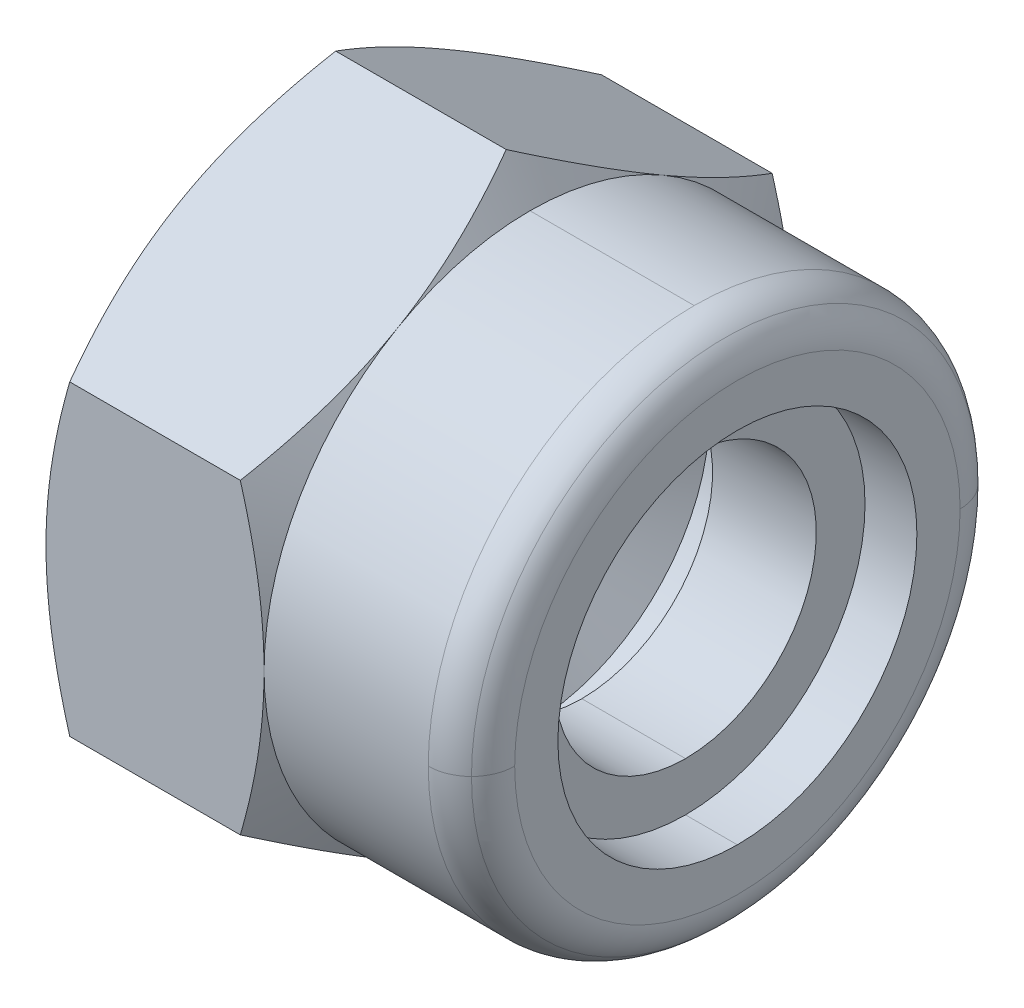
ISO-10303-21;
HEADER;
FILE_DESCRIPTION(('STEP AP214'),'2;1');
FILE_NAME('part.step','',(''),(''),'','','');
FILE_SCHEMA(('AUTOMOTIVE_DESIGN { 1 0 10303 214 1 1 1 1 }'));
ENDSEC;
DATA;
#1=APPLICATION_CONTEXT('core data for automotive mechanical design processes');
#2=APPLICATION_PROTOCOL_DEFINITION('international standard','automotive_design',2000,#1);
#3=PRODUCT_CONTEXT('',#1,'mechanical');
#4=PRODUCT('Part','Part','',(#3));
#5=PRODUCT_RELATED_PRODUCT_CATEGORY('part','',(#4));
#6=PRODUCT_DEFINITION_FORMATION('','',#4);
#7=PRODUCT_DEFINITION_CONTEXT('part definition',#1,'design');
#8=PRODUCT_DEFINITION('design','',#6,#7);
#9=PRODUCT_DEFINITION_SHAPE('','',#8);
#10=(LENGTH_UNIT() NAMED_UNIT(*) SI_UNIT(.MILLI.,.METRE.));
#11=(NAMED_UNIT(*) PLANE_ANGLE_UNIT() SI_UNIT($,.RADIAN.));
#12=(NAMED_UNIT(*) SI_UNIT($,.STERADIAN.) SOLID_ANGLE_UNIT());
#13=UNCERTAINTY_MEASURE_WITH_UNIT(LENGTH_MEASURE(1.E-05),#10,'distance_accuracy_value','');
#14=(GEOMETRIC_REPRESENTATION_CONTEXT(3) GLOBAL_UNCERTAINTY_ASSIGNED_CONTEXT((#13)) GLOBAL_UNIT_ASSIGNED_CONTEXT((#10,
#11,#12)) REPRESENTATION_CONTEXT('',''));
#15=CARTESIAN_POINT('',(0.,0.,0.));
#16=DIRECTION('',(0.,0.,1.));
#17=DIRECTION('',(1.,0.,0.));
#18=AXIS2_PLACEMENT_3D('',#15,#16,#17);
#19=CARTESIAN_POINT('',(9.,-5.773502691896,0.));
#20=DIRECTION('',(0.,0.866025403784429,-0.500000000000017));
#21=DIRECTION('',(-1.,0.,0.));
#22=AXIS2_PLACEMENT_3D('',#19,#20,#21);
#23=PLANE('',#22);
#24=DIRECTION('',(1.,0.,0.));
#25=VECTOR('',#24,1.);
#26=CARTESIAN_POINT('',(0.4465819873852,-5.773502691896,0.));
#27=LINE('',#26,#25);
#28=CARTESIAN_POINT('',(0.4465819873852,-5.773502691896,0.));
#29=VERTEX_POINT('',#28);
#30=CARTESIAN_POINT('',(3.653418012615,-5.773502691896,0.));
#31=VERTEX_POINT('',#30);
#32=EDGE_CURVE('E52',#29,#31,#27,.T.);
#33=ORIENTED_EDGE('',*,*,#32,.T.);
#34=CARTESIAN_POINT('',(4.09999999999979,-4.3301270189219,2.49999999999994));
#35=CARTESIAN_POINT('',(4.10000823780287,-4.36961085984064,2.4315963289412));
#36=CARTESIAN_POINT('',(4.09892829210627,-4.4090950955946,2.36319340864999));
#37=CARTESIAN_POINT('',(4.09461601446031,-4.48803351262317,2.22645356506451));
#38=CARTESIAN_POINT('',(4.09138405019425,-4.52748769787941,2.15811663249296));
#39=CARTESIAN_POINT('',(4.08277034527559,-4.60654469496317,2.02121039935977));
#40=CARTESIAN_POINT('',(4.07737799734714,-4.646147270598,1.95264163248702));
#41=CARTESIAN_POINT('',(4.06451696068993,-4.72524834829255,1.81563256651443));
#42=CARTESIAN_POINT('',(4.05704811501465,-4.76474684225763,1.74719227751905));
#43=CARTESIAN_POINT('',(4.04004091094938,-4.84382606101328,1.61019355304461));
#44=CARTESIAN_POINT('',(4.03049321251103,-4.88340633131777,1.54163601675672));
#45=CARTESIAN_POINT('',(4.00933632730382,-4.96280192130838,1.40414312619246));
#46=CARTESIAN_POINT('',(3.99770944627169,-5.002616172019,1.33520988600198));
#47=CARTESIAN_POINT('',(3.97250348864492,-5.08229090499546,1.19720262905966));
#48=CARTESIAN_POINT('',(3.95891387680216,-5.12215040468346,1.12812997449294));
#49=CARTESIAN_POINT('',(3.92980607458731,-5.20202036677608,0.989708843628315));
#50=CARTESIAN_POINT('',(3.91427314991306,-5.24202943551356,0.920362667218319));
#51=CARTESIAN_POINT('',(3.88128219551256,-5.32233301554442,0.781209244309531));
#52=CARTESIAN_POINT('',(3.86380444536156,-5.36262566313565,0.711405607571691));
#53=CARTESIAN_POINT('',(3.82692900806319,-5.44360436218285,0.571154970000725));
#54=CARTESIAN_POINT('',(3.80750773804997,-5.48428795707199,0.500712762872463));
#55=CARTESIAN_POINT('',(3.7667488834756,-5.56613847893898,0.359012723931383));
#56=CARTESIAN_POINT('',(3.74538490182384,-5.60730226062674,0.287760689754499));
#57=CARTESIAN_POINT('',(3.70074204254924,-5.69018628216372,0.144277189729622));
#58=CARTESIAN_POINT('',(3.67743488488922,-5.73190258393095,0.0720522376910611));
#59=CARTESIAN_POINT('',(3.65341801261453,-5.77350269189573,0.));
#60=B_SPLINE_CURVE_WITH_KNOTS('',3,(#34,#35,#36,#37,#38,#39,#40,#41,#42,#43,#44,#45,#46,#47,#48,
#49,#50,#51,#52,#53,#54,#55,#56,#57,#58,#59),.UNSPECIFIED.,.F.,.F.,(4,2,2,2,2,2,2,2,2,2,2,2,4),
(0.,0.23693544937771,0.473830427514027,0.711903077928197,0.949993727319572,1.18917701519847,
1.43050209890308,1.67317430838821,1.91781279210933,2.16520794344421,2.41608902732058,
2.67112251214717,2.93091193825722),.UNSPECIFIED.);
#61=CARTESIAN_POINT('',(4.1,-4.330127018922,2.5));
#62=VERTEX_POINT('',#61);
#63=EDGE_CURVE('E297',#62,#31,#60,.T.);
#64=ORIENTED_EDGE('',*,*,#63,.F.);
#65=CARTESIAN_POINT('',(3.65341801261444,-2.88675134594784,4.99999999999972));
#66=CARTESIAN_POINT('',(3.67744812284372,-2.92837327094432,4.92790743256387));
#67=CARTESIAN_POINT('',(3.70076750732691,-2.97008722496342,4.85562785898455));
#68=CARTESIAN_POINT('',(3.74543324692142,-3.0529539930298,4.71202534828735));
#69=CARTESIAN_POINT('',(3.76680787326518,-3.09410312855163,4.64070907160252));
#70=CARTESIAN_POINT('',(3.80758644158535,-3.17594482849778,4.49888961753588));
#71=CARTESIAN_POINT('',(3.82701676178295,-3.21663394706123,4.42839205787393));
#72=CARTESIAN_POINT('',(3.86390875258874,-3.29765845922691,4.28804778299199));
#73=CARTESIAN_POINT('',(3.88139397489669,-3.33799093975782,4.21820558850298));
#74=CARTESIAN_POINT('',(3.91439827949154,-3.41840441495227,4.07898919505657));
#75=CARTESIAN_POINT('',(3.92993703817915,-3.45848322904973,4.00961841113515));
#76=CARTESIAN_POINT('',(3.95905514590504,-3.53848008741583,3.87113720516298));
#77=CARTESIAN_POINT('',(3.97264916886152,-3.57839685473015,3.80202913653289));
#78=CARTESIAN_POINT('',(3.99785317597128,-3.65810672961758,3.66396413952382));
#79=CARTESIAN_POINT('',(4.00947491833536,-3.69789907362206,3.59500892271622));
#80=CARTESIAN_POINT('',(4.03062030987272,-3.77727758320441,3.45748757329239));
#81=CARTESIAN_POINT('',(4.04016166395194,-3.81686244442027,3.38892341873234));
#82=CARTESIAN_POINT('',(4.0571556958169,-3.89597195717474,3.25192350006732));
#83=CARTESIAN_POINT('',(4.06461770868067,-3.93549605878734,3.18348857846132));
#84=CARTESIAN_POINT('',(4.07745082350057,-4.01453334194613,3.04659212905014));
#85=CARTESIAN_POINT('',(4.08282590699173,-4.05404639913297,2.9781309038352));
#86=CARTESIAN_POINT('',(4.09141234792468,-4.1329614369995,2.84143152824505));
#87=CARTESIAN_POINT('',(4.09463359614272,-4.17236308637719,2.7731938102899));
#88=CARTESIAN_POINT('',(4.09893197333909,-4.25121933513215,2.63663785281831));
#89=CARTESIAN_POINT('',(4.10000807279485,-4.29067395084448,2.56831959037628));
#90=CARTESIAN_POINT('',(4.09999999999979,-4.3301270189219,2.49999999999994));
#91=B_SPLINE_CURVE_WITH_KNOTS('',3,(#65,#66,#67,#68,#69,#70,#71,#72,#73,#74,#75,#76,#77,#78,#79,
#80,#81,#82,#83,#84,#85,#86,#87,#88,#89,#90),.UNSPECIFIED.,.F.,.F.,(4,2,2,2,2,2,2,2,2,2,2,2,4),
(0.,0.25993254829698,0.515114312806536,0.766149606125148,1.01370576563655,1.25851301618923,
1.50136279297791,1.74270961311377,1.98191451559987,2.2200275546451,2.45768405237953,
2.69424155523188,2.93091256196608),.UNSPECIFIED.);
#92=CARTESIAN_POINT('',(3.653418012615,-2.886751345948,5.));
#93=VERTEX_POINT('',#92);
#94=EDGE_CURVE('E1559',#93,#62,#91,.T.);
#95=ORIENTED_EDGE('',*,*,#94,.F.);
#96=DIRECTION('',(-1.,0.,0.));
#97=VECTOR('',#96,1.);
#98=CARTESIAN_POINT('',(3.653418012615,-2.886751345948,5.));
#99=LINE('',#98,#97);
#100=CARTESIAN_POINT('',(0.4465819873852,-2.886751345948,5.));
#101=VERTEX_POINT('',#100);
#102=EDGE_CURVE('E1449',#93,#101,#99,.T.);
#103=ORIENTED_EDGE('',*,*,#102,.T.);
#104=CARTESIAN_POINT('',(0.,-4.33012701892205,2.50000000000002));
#105=CARTESIAN_POINT('',(-8.23780317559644E-06,-4.29062962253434,2.56839584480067));
#106=CARTESIAN_POINT('',(0.00107170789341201,-4.25113307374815,2.63679165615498));
#107=CARTESIAN_POINT('',(0.00538398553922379,-4.17218210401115,2.77352425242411));
#108=CARTESIAN_POINT('',(0.00861594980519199,-4.1327276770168,2.84186104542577));
#109=CARTESIAN_POINT('',(0.017229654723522,-4.05369189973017,2.97877952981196));
#110=CARTESIAN_POINT('',(0.0226220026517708,-4.01411089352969,3.0473607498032));
#111=CARTESIAN_POINT('',(0.0354830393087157,-3.93500810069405,3.18436882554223));
#112=CARTESIAN_POINT('',(0.0429518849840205,-3.89548631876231,3.25279566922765));
#113=CARTESIAN_POINT('',(0.0599590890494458,-3.81638155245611,3.38977964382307));
#114=CARTESIAN_POINT('',(0.0695067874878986,-3.77679911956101,3.458335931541));
#115=CARTESIAN_POINT('',(0.0906636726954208,-3.69742457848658,3.59584097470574));
#116=CARTESIAN_POINT('',(0.102290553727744,-3.6576337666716,3.66478774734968));
#117=CARTESIAN_POINT('',(0.127496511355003,-3.577953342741,3.80279171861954));
#118=CARTESIAN_POINT('',(0.141086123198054,-3.53806441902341,3.87184738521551));
#119=CARTESIAN_POINT('',(0.170193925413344,-3.45812318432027,4.01022736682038));
#120=CARTESIAN_POINT('',(0.185726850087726,-3.41807216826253,4.07954932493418));
#121=CARTESIAN_POINT('',(0.218717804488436,-3.33771355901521,4.21867097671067));
#122=CARTESIAN_POINT('',(0.236195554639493,-3.29740816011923,4.28846725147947));
#123=CARTESIAN_POINT('',(0.273070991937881,-3.21643689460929,4.42872218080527));
#124=CARTESIAN_POINT('',(0.292492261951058,-3.1757739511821,4.49917631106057));
#125=CARTESIAN_POINT('',(0.333251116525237,-3.09398337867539,4.64091096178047));
#126=CARTESIAN_POINT('',(0.354615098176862,-3.05285919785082,4.71218585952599));
#127=CARTESIAN_POINT('',(0.399257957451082,-2.97004085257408,4.85570727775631));
#128=CARTESIAN_POINT('',(0.422565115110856,-2.92835036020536,4.92794713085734));
#129=CARTESIAN_POINT('',(0.446581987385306,-2.88675134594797,4.99999999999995));
#130=B_SPLINE_CURVE_WITH_KNOTS('',3,(#104,#105,#106,#107,#108,#109,#110,#111,#112,#113,#114,
#115,#116,#117,#118,#119,#120,#121,#122,#123,#124,#125,#126,#127,#128,#129),.UNSPECIFIED.,.F.,
.F.,(4,2,2,2,2,2,2,2,2,2,2,2,4),(0.,0.23693544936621,0.473830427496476,0.711903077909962,
0.949993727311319,1.1891770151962,1.43050209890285,1.67317430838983,1.91781279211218,
2.16520794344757,2.4160890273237,2.6711225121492,2.9309119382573),.UNSPECIFIED.);
#131=CARTESIAN_POINT('',(0.,-4.330127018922,2.5));
#132=VERTEX_POINT('',#131);
#133=EDGE_CURVE('E1355',#132,#101,#130,.T.);
#134=ORIENTED_EDGE('',*,*,#133,.F.);
#135=CARTESIAN_POINT('',(0.446581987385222,-5.77350269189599,0.));
#136=CARTESIAN_POINT('',(0.422551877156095,-5.731879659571,0.0720919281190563));
#137=CARTESIAN_POINT('',(0.399232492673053,-5.6901406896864,0.144357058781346));
#138=CARTESIAN_POINT('',(0.354566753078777,-5.60721065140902,0.287923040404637));
#139=CARTESIAN_POINT('',(0.333192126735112,-5.56602351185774,0.359217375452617));
#140=CARTESIAN_POINT('',(0.292413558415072,-5.48412511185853,0.501004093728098));
#141=CARTESIAN_POINT('',(0.272983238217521,-5.4434169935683,0.571490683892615));
#142=CARTESIAN_POINT('',(0.236091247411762,-5.36238754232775,0.711832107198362));
#143=CARTESIAN_POINT('',(0.218606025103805,-5.32206866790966,0.781682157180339));
#144=CARTESIAN_POINT('',(0.185601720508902,-5.24171047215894,0.920930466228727));
#145=CARTESIAN_POINT('',(0.170062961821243,-5.20167301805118,0.990325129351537));
#146=CARTESIAN_POINT('',(0.140944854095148,-5.12174320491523,1.12884504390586));
#147=CARTESIAN_POINT('',(0.127350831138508,-5.08185224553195,1.19796801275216));
#148=CARTESIAN_POINT('',(0.102146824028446,-5.00213938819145,1.33603128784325));
#149=CARTESIAN_POINT('',(0.0905250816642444,-4.9623185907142,1.40497007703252));
#150=CARTESIAN_POINT('',(0.0693796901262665,-4.88291086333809,1.54247455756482));
#151=CARTESIAN_POINT('',(0.059838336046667,-4.84332499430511,1.61103813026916));
#152=CARTESIAN_POINT('',(0.0428443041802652,-4.76423434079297,1.74804893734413));
#153=CARTESIAN_POINT('',(0.0353822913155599,-4.72473001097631,1.81649527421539));
#154=CARTESIAN_POINT('',(0.0225491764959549,-4.64569284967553,1.95339179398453));
#155=CARTESIAN_POINT('',(0.0171740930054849,-4.60616021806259,2.02184171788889));
#156=CARTESIAN_POINT('',(0.00858765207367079,-4.52723260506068,2.15853383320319));
#157=CARTESIAN_POINT('',(0.0053664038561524,-4.48783783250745,2.22677552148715));
#158=CARTESIAN_POINT('',(0.00106802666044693,-4.40900502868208,2.36334501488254));
#159=CARTESIAN_POINT('',(-8.07279510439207E-06,-4.36956698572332,2.43167284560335));
#160=CARTESIAN_POINT('',(0.,-4.33012701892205,2.50000000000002));
#161=B_SPLINE_CURVE_WITH_KNOTS('',3,(#135,#136,#137,#138,#139,#140,#141,#142,#143,#144,#145,
#146,#147,#148,#149,#150,#151,#152,#153,#154,#155,#156,#157,#158,#159,#160),.UNSPECIFIED.,.F.,
.F.,(4,2,2,2,2,2,2,2,2,2,2,2,4),(0.,0.259932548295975,0.515114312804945,0.766149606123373,
1.01370576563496,1.25851301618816,1.50136279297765,1.74270961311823,1.9819145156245,
2.22002755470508,2.45768405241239,2.69424155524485,2.93091256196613),.UNSPECIFIED.);
#162=EDGE_CURVE('E11',#29,#132,#161,.T.);
#163=ORIENTED_EDGE('',*,*,#162,.F.);
#164=EDGE_LOOP('',(#33,#64,#95,#103,#134,#163));
#165=FACE_BOUND('',#164,.T.);
#166=ADVANCED_FACE('F16',(#165),#23,.F.);
#167=CARTESIAN_POINT('',(0.2232909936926,0.,0.));
#168=DIRECTION('',(1.,0.,0.));
#169=DIRECTION('',(0.,-1.,0.));
#170=AXIS2_PLACEMENT_3D('',#167,#168,#169);
#171=CONICAL_SURFACE('',#170,5.386751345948,1.0471975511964);
#172=CARTESIAN_POINT('',(0.,0.,0.));
#173=DIRECTION('',(-1.,0.,0.));
#174=DIRECTION('',(0.,-1.,0.));
#175=AXIS2_PLACEMENT_3D('',#172,#173,#174);
#176=CIRCLE('',#175,5.);
#177=CARTESIAN_POINT('',(0.,-4.330127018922,-2.5));
#178=VERTEX_POINT('',#177);
#179=EDGE_CURVE('E146',#178,#132,#176,.T.);
#180=ORIENTED_EDGE('',*,*,#179,.F.);
#181=CARTESIAN_POINT('',(0.,-4.33012701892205,-2.50000000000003));
#182=CARTESIAN_POINT('',(-8.23780312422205E-06,-4.36961085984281,-2.43159632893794));
#183=CARTESIAN_POINT('',(0.00107170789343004,-4.4090950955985,-2.3631934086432));
#184=CARTESIAN_POINT('',(0.00538398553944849,-4.48803351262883,-2.22645356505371));
#185=CARTESIAN_POINT('',(0.00861594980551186,-4.52748769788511,-2.15811663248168));
#186=CARTESIAN_POINT('',(0.0172296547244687,-4.60654469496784,-2.02121039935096));
#187=CARTESIAN_POINT('',(0.0226220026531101,-4.64614727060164,-1.95264163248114));
#188=CARTESIAN_POINT('',(0.0354830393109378,-4.72524834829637,-1.81563256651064));
#189=CARTESIAN_POINT('',(0.0429518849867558,-4.76474684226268,-1.74719227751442));
#190=CARTESIAN_POINT('',(0.0599590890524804,-4.84382606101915,-1.61019355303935));
#191=CARTESIAN_POINT('',(0.0695067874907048,-4.88340633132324,-1.54163601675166));
#192=CARTESIAN_POINT('',(0.090663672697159,-4.96280192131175,-1.40414312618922));
#193=CARTESIAN_POINT('',(0.102290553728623,-5.00261617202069,-1.33520988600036));
#194=CARTESIAN_POINT('',(0.12749651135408,-5.08229090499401,-1.19720262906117));
#195=CARTESIAN_POINT('',(0.141086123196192,-5.12215040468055,-1.12812997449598));
#196=CARTESIAN_POINT('',(0.170193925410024,-5.20202036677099,-0.989708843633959));
#197=CARTESIAN_POINT('',(0.185726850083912,-5.24202943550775,-0.920362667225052));
#198=CARTESIAN_POINT('',(0.218717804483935,-5.32233301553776,-0.78120924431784));
#199=CARTESIAN_POINT('',(0.236195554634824,-5.36262566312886,-0.711405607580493));
#200=CARTESIAN_POINT('',(0.273070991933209,-5.44360436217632,-0.571154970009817));
#201=CARTESIAN_POINT('',(0.292492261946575,-5.48428795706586,-0.500712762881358));
#202=CARTESIAN_POINT('',(0.333251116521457,-5.56613847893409,-0.359012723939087));
#203=CARTESIAN_POINT('',(0.354615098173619,-5.60730226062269,-0.287760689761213));
#204=CARTESIAN_POINT('',(0.399257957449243,-5.6901862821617,-0.144277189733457));
#205=CARTESIAN_POINT('',(0.422565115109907,-5.73190258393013,-0.0720522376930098));
#206=CARTESIAN_POINT('',(0.446581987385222,-5.77350269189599,0.));
#207=B_SPLINE_CURVE_WITH_KNOTS('',3,(#181,#182,#183,#184,#185,#186,#187,#188,#189,#190,#191,
#192,#193,#194,#195,#196,#197,#198,#199,#200,#201,#202,#203,#204,#205,#206),.UNSPECIFIED.,.F.,
.F.,(4,2,2,2,2,2,2,2,2,2,2,2,4),(0.,0.236935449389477,0.473830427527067,0.711903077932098,
0.949993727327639,1.18917701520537,1.43050209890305,1.67317430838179,1.91781279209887,
2.16520794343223,2.41608902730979,2.67112251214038,2.9309119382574),.UNSPECIFIED.);
#208=EDGE_CURVE('E29',#178,#29,#207,.T.);
#209=ORIENTED_EDGE('',*,*,#208,.T.);
#210=ORIENTED_EDGE('',*,*,#162,.T.);
#211=EDGE_LOOP('',(#180,#209,#210));
#212=FACE_BOUND('',#211,.T.);
#213=ADVANCED_FACE('F18',(#212),#171,.T.);
#214=CARTESIAN_POINT('',(9.,-2.886751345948,-5.));
#215=DIRECTION('',(0.,0.866025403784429,0.500000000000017));
#216=DIRECTION('',(1.,0.,0.));
#217=AXIS2_PLACEMENT_3D('',#214,#215,#216);
#218=PLANE('',#217);
#219=CARTESIAN_POINT('',(0.446581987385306,-2.88675134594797,-4.99999999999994));
#220=CARTESIAN_POINT('',(0.42255187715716,-2.92837327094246,-4.92790743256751));
#221=CARTESIAN_POINT('',(0.399232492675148,-2.97008722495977,-4.85562785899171));
#222=CARTESIAN_POINT('',(0.35456675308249,-3.05295399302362,-4.71202534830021));
#223=CARTESIAN_POINT('',(0.333192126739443,-3.09410312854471,-4.64070907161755));
#224=CARTESIAN_POINT('',(0.292413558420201,-3.17594482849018,-4.49888961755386));
#225=CARTESIAN_POINT('',(0.272983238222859,-3.2166339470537,-4.42839205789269));
#226=CARTESIAN_POINT('',(0.236091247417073,-3.29765845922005,-4.28804778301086));
#227=CARTESIAN_POINT('',(0.218606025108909,-3.33799093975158,-4.21820558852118));
#228=CARTESIAN_POINT('',(0.185601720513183,-3.41840441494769,-4.07898919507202));
#229=CARTESIAN_POINT('',(0.17006296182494,-3.45848322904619,-4.00961841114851));
#230=CARTESIAN_POINT('',(0.140944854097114,-3.53848008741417,-3.87113720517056));
#231=CARTESIAN_POINT('',(0.127350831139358,-3.57839685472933,-3.80202913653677));
#232=CARTESIAN_POINT('',(0.102146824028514,-3.65810672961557,-3.66396413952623));
#233=CARTESIAN_POINT('',(0.0905250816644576,-3.69789907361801,-3.59500892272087));
#234=CARTESIAN_POINT('',(0.0693796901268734,-3.77727758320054,-3.45748757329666));
#235=CARTESIAN_POINT('',(0.059838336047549,-3.81686244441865,-3.38892341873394));
#236=CARTESIAN_POINT('',(0.0428443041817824,-3.89597195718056,-3.25192350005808));
#237=CARTESIAN_POINT('',(0.0353822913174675,-3.93549605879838,-3.18348857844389));
#238=CARTESIAN_POINT('',(0.0225491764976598,-4.01453334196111,-3.04659212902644));
#239=CARTESIAN_POINT('',(0.0171740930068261,-4.05404639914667,-2.97813090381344));
#240=CARTESIAN_POINT('',(0.0085876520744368,-4.13296143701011,-2.84143152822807));
#241=CARTESIAN_POINT('',(0.00536640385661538,-4.17236308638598,-2.77319381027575));
#242=CARTESIAN_POINT('',(0.0010680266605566,-4.25121933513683,-2.63663785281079));
#243=CARTESIAN_POINT('',(-8.07279513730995E-06,-4.29067395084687,-2.56831959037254));
#244=CARTESIAN_POINT('',(0.,-4.33012701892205,-2.50000000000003));
#245=B_SPLINE_CURVE_WITH_KNOTS('',3,(#219,#220,#221,#222,#223,#224,#225,#226,#227,#228,#229,
#230,#231,#232,#233,#234,#235,#236,#237,#238,#239,#240,#241,#242,#243,#244),.UNSPECIFIED.,.F.,
.F.,(4,2,2,2,2,2,2,2,2,2,2,2,4),(0.,0.25993254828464,0.515114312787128,0.766149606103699,
1.01370576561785,1.25851301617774,1.5013627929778,1.74270961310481,1.98191451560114,
2.2200275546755,2.4576840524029,2.69424155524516,2.93091256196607),.UNSPECIFIED.);
#246=CARTESIAN_POINT('',(0.4465819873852,-2.886751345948,-5.));
#247=VERTEX_POINT('',#246);
#248=EDGE_CURVE('E129',#247,#178,#245,.T.);
#249=ORIENTED_EDGE('',*,*,#248,.F.);
#250=DIRECTION('',(-1.,0.,0.));
#251=VECTOR('',#250,1.);
#252=CARTESIAN_POINT('',(3.653418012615,-2.886751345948,-5.));
#253=LINE('',#252,#251);
#254=CARTESIAN_POINT('',(3.653418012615,-2.886751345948,-5.));
#255=VERTEX_POINT('',#254);
#256=EDGE_CURVE('E108',#255,#247,#253,.T.);
#257=ORIENTED_EDGE('',*,*,#256,.F.);
#258=CARTESIAN_POINT('',(4.09999999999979,-4.3301270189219,-2.49999999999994));
#259=CARTESIAN_POINT('',(4.10000823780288,-4.29062962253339,-2.56839584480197));
#260=CARTESIAN_POINT('',(4.09892829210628,-4.25113307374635,-2.63679165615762));
#261=CARTESIAN_POINT('',(4.09461601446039,-4.17218210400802,-2.77352425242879));
#262=CARTESIAN_POINT('',(4.09138405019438,-4.13272767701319,-2.84186104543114));
#263=CARTESIAN_POINT('',(4.0827703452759,-4.05369189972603,-2.97877952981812));
#264=CARTESIAN_POINT('',(4.07737799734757,-4.01411089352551,-3.04736074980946));
#265=CARTESIAN_POINT('',(4.06451696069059,-3.93500810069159,-3.18436882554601));
#266=CARTESIAN_POINT('',(4.05704811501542,-3.8954863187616,-3.25279566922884));
#267=CARTESIAN_POINT('',(4.04004091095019,-3.81638155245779,-3.38977964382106));
#268=CARTESIAN_POINT('',(4.03049321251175,-3.77679911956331,-3.45833593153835));
#269=CARTESIAN_POINT('',(4.00933632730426,-3.69742457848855,-3.59584097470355));
#270=CARTESIAN_POINT('',(3.99770944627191,-3.6576337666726,-3.66478774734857));
#271=CARTESIAN_POINT('',(3.97250348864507,-3.5779533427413,-3.8027917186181));
#272=CARTESIAN_POINT('',(3.95891387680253,-3.53806441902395,-3.87184738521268));
#273=CARTESIAN_POINT('',(3.92980607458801,-3.45812318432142,-4.01022736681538));
#274=CARTESIAN_POINT('',(3.91427314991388,-3.41807216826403,-4.07954932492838));
#275=CARTESIAN_POINT('',(3.88128219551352,-3.33771355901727,-4.21867097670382));
#276=CARTESIAN_POINT('',(3.86380444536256,-3.29740816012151,-4.28846725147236));
#277=CARTESIAN_POINT('',(3.82692900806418,-3.2164368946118,-4.42872218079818));
#278=CARTESIAN_POINT('',(3.80750773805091,-3.17577395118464,-4.49917631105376));
#279=CARTESIAN_POINT('',(3.76674888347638,-3.0939833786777,-4.64091096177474));
#280=CARTESIAN_POINT('',(3.74538490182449,-3.05285919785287,-4.71218585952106));
#281=CARTESIAN_POINT('',(3.70074204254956,-2.97004085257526,-4.8557072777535));
#282=CARTESIAN_POINT('',(3.67743488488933,-2.92835036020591,-4.92794713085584));
#283=CARTESIAN_POINT('',(3.65341801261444,-2.88675134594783,-4.99999999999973));
#284=B_SPLINE_CURVE_WITH_KNOTS('',3,(#258,#259,#260,#261,#262,#263,#264,#265,#266,#267,#268,
#269,#270,#271,#272,#273,#274,#275,#276,#277,#278,#279,#280,#281,#282,#283),.UNSPECIFIED.,.F.,
.F.,(4,2,2,2,2,2,2,2,2,2,2,2,4),(0.,0.236935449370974,0.473830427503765,0.711903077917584,
0.949993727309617,1.18917701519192,1.43050209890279,1.67317430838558,1.91781279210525,
2.16520794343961,2.41608902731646,2.67112251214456,2.93091193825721),.UNSPECIFIED.);
#285=CARTESIAN_POINT('',(4.1,-4.330127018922,-2.5));
#286=VERTEX_POINT('',#285);
#287=EDGE_CURVE('E268',#286,#255,#284,.T.);
#288=ORIENTED_EDGE('',*,*,#287,.F.);
#289=CARTESIAN_POINT('',(3.65341801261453,-5.77350269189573,0.));
#290=CARTESIAN_POINT('',(3.67744812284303,-5.73187965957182,-0.0720919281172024));
#291=CARTESIAN_POINT('',(3.70076750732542,-5.69014068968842,-0.144357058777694));
#292=CARTESIAN_POINT('',(3.74543324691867,-5.60721065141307,-0.287923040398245));
#293=CARTESIAN_POINT('',(3.76680787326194,-5.56602351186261,-0.359217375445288));
#294=CARTESIAN_POINT('',(3.80758644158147,-5.48412511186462,-0.501004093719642));
#295=CARTESIAN_POINT('',(3.82701676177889,-5.44341699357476,-0.571490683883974));
#296=CARTESIAN_POINT('',(3.86390875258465,-5.36238754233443,-0.711832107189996));
#297=CARTESIAN_POINT('',(3.88139397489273,-5.32206866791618,-0.781682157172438));
#298=CARTESIAN_POINT('',(3.91439827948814,-5.24171047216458,-0.92093046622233));
#299=CARTESIAN_POINT('',(3.92993703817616,-5.2016730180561,-0.990325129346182));
#300=CARTESIAN_POINT('',(3.95905514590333,-5.12174320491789,-1.12884504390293));
#301=CARTESIAN_POINT('',(3.97264916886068,-5.08185224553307,-1.19796801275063));
#302=CARTESIAN_POINT('',(3.9978531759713,-5.00213938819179,-1.33603128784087));
#303=CARTESIAN_POINT('',(4.00947491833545,-4.96231859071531,-1.40497007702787));
#304=CARTESIAN_POINT('',(4.03062030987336,-4.88291086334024,-1.54247455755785));
#305=CARTESIAN_POINT('',(4.04016166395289,-4.84332499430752,-1.61103813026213));
#306=CARTESIAN_POINT('',(4.0571556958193,-4.76423434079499,-1.74804893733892));
#307=CARTESIAN_POINT('',(4.06461770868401,-4.72473001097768,-1.81649527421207));
#308=CARTESIAN_POINT('',(4.07745082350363,-4.64569284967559,-1.95339179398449));
#309=CARTESIAN_POINT('',(4.08282590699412,-4.606160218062,-2.02184171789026));
#310=CARTESIAN_POINT('',(4.09141234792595,-4.52723260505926,-2.15853383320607));
#311=CARTESIAN_POINT('',(4.09463359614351,-4.48783783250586,-2.22677552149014));
#312=CARTESIAN_POINT('',(4.09893197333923,-4.40900502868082,-2.36334501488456));
#313=CARTESIAN_POINT('',(4.10000807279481,-4.36956698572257,-2.43167284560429));
#314=CARTESIAN_POINT('',(4.09999999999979,-4.3301270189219,-2.49999999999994));
#315=B_SPLINE_CURVE_WITH_KNOTS('',3,(#289,#290,#291,#292,#293,#294,#295,#296,#297,#298,#299,
#300,#301,#302,#303,#304,#305,#306,#307,#308,#309,#310,#311,#312,#313,#314),.UNSPECIFIED.,.F.,
.F.,(4,2,2,2,2,2,2,2,2,2,2,2,4),(0.,0.259932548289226,0.515114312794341,0.766149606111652,
1.01370576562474,1.25851301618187,1.50136279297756,1.74270961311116,1.98191451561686,
2.22002755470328,2.45768405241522,2.69424155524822,2.93091256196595),.UNSPECIFIED.);
#316=EDGE_CURVE('E332',#31,#286,#315,.T.);
#317=ORIENTED_EDGE('',*,*,#316,.F.);
#318=ORIENTED_EDGE('',*,*,#32,.F.);
#319=ORIENTED_EDGE('',*,*,#208,.F.);
#320=EDGE_LOOP('',(#249,#257,#288,#317,#318,#319));
#321=FACE_BOUND('',#320,.T.);
#322=ADVANCED_FACE('F131',(#321),#218,.F.);
#323=CARTESIAN_POINT('',(3.876709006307,0.,0.));
#324=DIRECTION('',(-1.,0.,0.));
#325=DIRECTION('',(0.,1.,0.));
#326=AXIS2_PLACEMENT_3D('',#323,#324,#325);
#327=CONICAL_SURFACE('',#326,5.386751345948,1.0471975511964);
#328=CARTESIAN_POINT('',(4.1,0.,0.));
#329=DIRECTION('',(-1.,0.,0.));
#330=DIRECTION('',(0.,-0.866025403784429,-0.500000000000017));
#331=AXIS2_PLACEMENT_3D('',#328,#329,#330);
#332=CIRCLE('',#331,5.);
#333=CARTESIAN_POINT('',(4.1,-5.,0.));
#334=VERTEX_POINT('',#333);
#335=EDGE_CURVE('E335',#286,#334,#332,.T.);
#336=ORIENTED_EDGE('',*,*,#335,.T.);
#337=CARTESIAN_POINT('',(4.1,0.,0.));
#338=DIRECTION('',(-1.,0.,0.));
#339=DIRECTION('',(0.,-1.,0.));
#340=AXIS2_PLACEMENT_3D('',#337,#338,#339);
#341=CIRCLE('',#340,5.);
#342=EDGE_CURVE('E1211',#334,#62,#341,.T.);
#343=ORIENTED_EDGE('',*,*,#342,.T.);
#344=ORIENTED_EDGE('',*,*,#63,.T.);
#345=ORIENTED_EDGE('',*,*,#316,.T.);
#346=EDGE_LOOP('',(#336,#343,#344,#345));
#347=FACE_BOUND('',#346,.T.);
#348=ADVANCED_FACE('F303',(#347),#327,.T.);
#349=CARTESIAN_POINT('',(5.64375,0.,0.));
#350=DIRECTION('',(-1.,0.,0.));
#351=DIRECTION('',(0.,1.,0.));
#352=AXIS2_PLACEMENT_3D('',#349,#350,#351);
#353=CYLINDRICAL_SURFACE('',#352,5.);
#354=CARTESIAN_POINT('',(4.1,0.,0.));
#355=DIRECTION('',(-1.,0.,0.));
#356=DIRECTION('',(0.,0.,1.));
#357=AXIS2_PLACEMENT_3D('',#354,#355,#356);
#358=CIRCLE('',#357,5.);
#359=CARTESIAN_POINT('',(4.1,0.,5.));
#360=VERTEX_POINT('',#359);
#361=CARTESIAN_POINT('',(4.1,4.330127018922,2.5));
#362=VERTEX_POINT('',#361);
#363=EDGE_CURVE('E1675',#360,#362,#358,.T.);
#364=ORIENTED_EDGE('',*,*,#363,.F.);
#365=CARTESIAN_POINT('',(4.1,0.,0.));
#366=DIRECTION('',(-1.,0.,0.));
#367=DIRECTION('',(0.,-0.866025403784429,0.500000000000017));
#368=AXIS2_PLACEMENT_3D('',#365,#366,#367);
#369=CIRCLE('',#368,5.);
#370=EDGE_CURVE('E1588',#62,#360,#369,.T.);
#371=ORIENTED_EDGE('',*,*,#370,.F.);
#372=ORIENTED_EDGE('',*,*,#342,.F.);
#373=DIRECTION('',(-1.,0.,0.));
#374=VECTOR('',#373,1.);
#375=CARTESIAN_POINT('',(7.1875,-5.,0.));
#376=LINE('',#375,#374);
#377=CARTESIAN_POINT('',(7.1875,-5.,0.));
#378=VERTEX_POINT('',#377);
#379=EDGE_CURVE('E255',#378,#334,#376,.T.);
#380=ORIENTED_EDGE('',*,*,#379,.F.);
#381=CARTESIAN_POINT('',(7.1875,0.,0.));
#382=DIRECTION('',(1.,0.,0.));
#383=DIRECTION('',(0.,0.,1.));
#384=AXIS2_PLACEMENT_3D('',#381,#382,#383);
#385=CIRCLE('',#384,5.);
#386=CARTESIAN_POINT('',(7.1875,0.,5.));
#387=VERTEX_POINT('',#386);
#388=EDGE_CURVE('E1188',#387,#378,#385,.T.);
#389=ORIENTED_EDGE('',*,*,#388,.F.);
#390=CARTESIAN_POINT('',(7.1875,0.,0.));
#391=DIRECTION('',(1.,0.,0.));
#392=DIRECTION('',(0.,1.,0.));
#393=AXIS2_PLACEMENT_3D('',#390,#391,#392);
#394=CIRCLE('',#393,5.);
#395=CARTESIAN_POINT('',(7.1875,5.,0.));
#396=VERTEX_POINT('',#395);
#397=EDGE_CURVE('E1296',#396,#387,#394,.T.);
#398=ORIENTED_EDGE('',*,*,#397,.F.);
#399=DIRECTION('',(-1.,0.,0.));
#400=VECTOR('',#399,1.);
#401=CARTESIAN_POINT('',(7.1875,5.,0.));
#402=LINE('',#401,#400);
#403=CARTESIAN_POINT('',(4.1,5.,0.));
#404=VERTEX_POINT('',#403);
#405=EDGE_CURVE('E1287',#396,#404,#402,.T.);
#406=ORIENTED_EDGE('',*,*,#405,.T.);
#407=CARTESIAN_POINT('',(4.1,0.,0.));
#408=DIRECTION('',(-1.,0.,0.));
#409=DIRECTION('',(0.,0.866025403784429,0.500000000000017));
#410=AXIS2_PLACEMENT_3D('',#407,#408,#409);
#411=CIRCLE('',#410,5.);
#412=EDGE_CURVE('E1612',#362,#404,#411,.T.);
#413=ORIENTED_EDGE('',*,*,#412,.F.);
#414=EDGE_LOOP('',(#364,#371,#372,#380,#389,#398,#406,#413));
#415=FACE_BOUND('',#414,.T.);
#416=ADVANCED_FACE('F312',(#415),#353,.T.);
#417=CARTESIAN_POINT('',(3.876709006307,0.,0.));
#418=DIRECTION('',(-1.,0.,0.));
#419=DIRECTION('',(0.,1.,0.));
#420=AXIS2_PLACEMENT_3D('',#417,#418,#419);
#421=CONICAL_SURFACE('',#420,5.386751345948,1.0471975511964);
#422=CARTESIAN_POINT('',(3.65341801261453,5.77350269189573,0.));
#423=CARTESIAN_POINT('',(3.67744812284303,5.73187965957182,0.0720919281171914));
#424=CARTESIAN_POINT('',(3.70076750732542,5.69014068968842,0.144357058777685));
#425=CARTESIAN_POINT('',(3.74543324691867,5.60721065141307,0.287923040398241));
#426=CARTESIAN_POINT('',(3.76680787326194,5.56602351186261,0.359217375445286));
#427=CARTESIAN_POINT('',(3.80758644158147,5.48412511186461,0.501004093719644));
#428=CARTESIAN_POINT('',(3.82701676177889,5.44341699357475,0.571490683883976));
#429=CARTESIAN_POINT('',(3.86390875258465,5.36238754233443,0.711832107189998));
#430=CARTESIAN_POINT('',(3.88139397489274,5.32206866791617,0.78168215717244));
#431=CARTESIAN_POINT('',(3.91439827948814,5.24171047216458,0.92093046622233));
#432=CARTESIAN_POINT('',(3.92993703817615,5.2016730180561,0.99032512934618));
#433=CARTESIAN_POINT('',(3.95905514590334,5.12174320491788,1.12884504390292));
#434=CARTESIAN_POINT('',(3.97264916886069,5.08185224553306,1.19796801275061));
#435=CARTESIAN_POINT('',(3.99785317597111,5.00213938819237,1.33603128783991));
#436=CARTESIAN_POINT('',(4.00947491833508,4.96231859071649,1.40497007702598));
#437=CARTESIAN_POINT('',(4.03062030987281,4.8829108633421,1.54247455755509));
#438=CARTESIAN_POINT('',(4.04016166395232,4.84332499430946,1.61103813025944));
#439=CARTESIAN_POINT('',(4.05715569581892,4.76423434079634,1.74804893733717));
#440=CARTESIAN_POINT('',(4.06461770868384,4.72473001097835,1.8164952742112));
#441=CARTESIAN_POINT('',(4.07745082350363,4.64569284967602,1.95339179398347));
#442=CARTESIAN_POINT('',(4.08282590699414,4.60616021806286,2.02184171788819));
#443=CARTESIAN_POINT('',(4.091412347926,4.52723260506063,2.15853383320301));
#444=CARTESIAN_POINT('',(4.09463359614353,4.48783783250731,2.22677552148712));
#445=CARTESIAN_POINT('',(4.09893197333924,4.40900502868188,2.36334501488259));
#446=CARTESIAN_POINT('',(4.1000080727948,4.36956698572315,2.43167284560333));
#447=CARTESIAN_POINT('',(4.09999999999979,4.3301270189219,2.49999999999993));
#448=B_SPLINE_CURVE_WITH_KNOTS('',3,(#422,#423,#424,#425,#426,#427,#428,#429,#430,#431,#432,
#433,#434,#435,#436,#437,#438,#439,#440,#441,#442,#443,#444,#445,#446,#447),.UNSPECIFIED.,.F.,
.F.,(4,2,2,2,2,2,2,2,2,2,2,2,4),(0.,0.259932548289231,0.515114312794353,0.766149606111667,
1.01370576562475,1.25851301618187,1.50136279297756,1.74270961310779,1.98191451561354,
2.2200275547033,2.4576840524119,2.69424155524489,2.93091256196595),.UNSPECIFIED.);
#449=CARTESIAN_POINT('',(3.653418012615,5.773502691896,0.));
#450=VERTEX_POINT('',#449);
#451=EDGE_CURVE('E1608',#450,#362,#448,.T.);
#452=ORIENTED_EDGE('',*,*,#451,.T.);
#453=ORIENTED_EDGE('',*,*,#412,.T.);
#454=CARTESIAN_POINT('',(4.1,0.,0.));
#455=DIRECTION('',(-1.,0.,0.));
#456=DIRECTION('',(0.,1.,0.));
#457=AXIS2_PLACEMENT_3D('',#454,#455,#456);
#458=CIRCLE('',#457,5.);
#459=CARTESIAN_POINT('',(4.1,4.330127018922,-2.5));
#460=VERTEX_POINT('',#459);
#461=EDGE_CURVE('E1220',#404,#460,#458,.T.);
#462=ORIENTED_EDGE('',*,*,#461,.T.);
#463=CARTESIAN_POINT('',(4.09999999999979,4.3301270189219,-2.49999999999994));
#464=CARTESIAN_POINT('',(4.10000823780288,4.36961085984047,-2.43159632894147));
#465=CARTESIAN_POINT('',(4.09892829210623,4.40909509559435,-2.36319340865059));
#466=CARTESIAN_POINT('',(4.09461601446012,4.48803351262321,-2.22645356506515));
#467=CARTESIAN_POINT('',(4.09138405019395,4.52748769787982,-2.15811663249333));
#468=CARTESIAN_POINT('',(4.08277034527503,4.60654469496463,-2.0212103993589));
#469=CARTESIAN_POINT('',(4.07737799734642,4.64614727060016,-1.95264163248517));
#470=CARTESIAN_POINT('',(4.06451696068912,4.72524834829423,-1.81563256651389));
#471=CARTESIAN_POINT('',(4.057048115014,4.76474684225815,-1.74719227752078));
#472=CARTESIAN_POINT('',(4.04004091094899,4.84382606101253,-1.61019355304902));
#473=CARTESIAN_POINT('',(4.03049321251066,4.88340633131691,-1.54163601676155));
#474=CARTESIAN_POINT('',(4.00933632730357,4.96280192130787,-1.40414312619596));
#475=CARTESIAN_POINT('',(3.99770944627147,5.00261617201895,-1.33520988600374));
#476=CARTESIAN_POINT('',(3.97250348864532,5.0822909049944,-1.19720262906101));
#477=CARTESIAN_POINT('',(3.95891387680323,5.12215040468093,-1.12812997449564));
#478=CARTESIAN_POINT('',(3.92980607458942,5.20202036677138,-0.989708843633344));
#479=CARTESIAN_POINT('',(3.91427314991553,5.24202943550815,-0.920362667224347));
#480=CARTESIAN_POINT('',(3.88128219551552,5.32233301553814,-0.781209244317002));
#481=CARTESIAN_POINT('',(3.86380444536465,5.3626256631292,-0.711405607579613));
#482=CARTESIAN_POINT('',(3.8269290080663,5.44360436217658,-0.571154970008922));
#483=CARTESIAN_POINT('',(3.80750773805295,5.48428795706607,-0.500712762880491));
#484=CARTESIAN_POINT('',(3.76674888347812,5.56613847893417,-0.359012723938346));
#485=CARTESIAN_POINT('',(3.74538490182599,5.60730226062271,-0.28776068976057));
#486=CARTESIAN_POINT('',(3.70074204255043,5.69018628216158,-0.14427718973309));
#487=CARTESIAN_POINT('',(3.67743488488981,5.73190258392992,-0.07205223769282));
#488=CARTESIAN_POINT('',(3.65341801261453,5.77350269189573,0.));
#489=B_SPLINE_CURVE_WITH_KNOTS('',3,(#463,#464,#465,#466,#467,#468,#469,#470,#471,#472,#473,
#474,#475,#476,#477,#478,#479,#480,#481,#482,#483,#484,#485,#486,#487,#488),.UNSPECIFIED.,.F.,
.F.,(4,2,2,2,2,2,2,2,2,2,2,2,4),(0.,0.23693544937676,0.473830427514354,0.7119030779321,
0.949993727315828,1.18917701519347,1.43050209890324,1.67317430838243,1.91781279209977,
2.16520794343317,2.41608902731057,2.67112251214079,2.93091193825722),.UNSPECIFIED.);
#490=EDGE_CURVE('E264',#460,#450,#489,.T.);
#491=ORIENTED_EDGE('',*,*,#490,.T.);
#492=EDGE_LOOP('',(#452,#453,#462,#491));
#493=FACE_BOUND('',#492,.T.);
#494=ADVANCED_FACE('F404',(#493),#421,.T.);
#495=CARTESIAN_POINT('',(9.,5.773502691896,0.));
#496=DIRECTION('',(0.,-0.866025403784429,0.500000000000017));
#497=DIRECTION('',(-1.,0.,0.));
#498=AXIS2_PLACEMENT_3D('',#495,#496,#497);
#499=PLANE('',#498);
#500=CARTESIAN_POINT('',(0.446581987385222,5.77350269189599,0.));
#501=CARTESIAN_POINT('',(0.422551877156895,5.73187965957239,-0.0720919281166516));
#502=CARTESIAN_POINT('',(0.399232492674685,5.69014068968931,-0.144357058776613));
#503=CARTESIAN_POINT('',(0.354566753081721,5.60721065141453,-0.287923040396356));
#504=CARTESIAN_POINT('',(0.333192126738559,5.56602351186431,-0.359217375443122));
#505=CARTESIAN_POINT('',(0.292413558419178,5.48412511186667,-0.501004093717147));
#506=CARTESIAN_POINT('',(0.272983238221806,5.44341699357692,-0.571490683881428));
#507=CARTESIAN_POINT('',(0.236091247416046,5.36238754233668,-0.711832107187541));
#508=CARTESIAN_POINT('',(0.218606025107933,5.32206866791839,-0.781682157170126));
#509=CARTESIAN_POINT('',(0.185601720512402,5.24171047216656,-0.920930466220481));
#510=CARTESIAN_POINT('',(0.170062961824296,5.20167301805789,-0.990325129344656));
#511=CARTESIAN_POINT('',(0.140944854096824,5.12174320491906,-1.12884504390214));
#512=CARTESIAN_POINT('',(0.127350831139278,5.08185224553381,-1.19796801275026));
#513=CARTESIAN_POINT('',(0.102146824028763,5.00213938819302,-1.33603128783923));
#514=CARTESIAN_POINT('',(0.0905250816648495,4.96231859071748,-1.40497007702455));
#515=CARTESIAN_POINT('',(0.0693796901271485,4.88291086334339,-1.54247455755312));
#516=CARTESIAN_POINT('',(0.0598383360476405,4.84332499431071,-1.61103813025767));
#517=CARTESIAN_POINT('',(0.0428443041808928,4.76423434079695,-1.74804893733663));
#518=CARTESIAN_POINT('',(0.0353822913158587,4.72473001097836,-1.81649527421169));
#519=CARTESIAN_POINT('',(0.0225491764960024,4.64569284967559,-1.95339179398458));
#520=CARTESIAN_POINT('',(0.0171740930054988,4.60616021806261,-2.02184171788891));
#521=CARTESIAN_POINT('',(0.00858765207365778,4.52723260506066,-2.15853383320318));
#522=CARTESIAN_POINT('',(0.00536640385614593,4.48783783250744,-2.22677552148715));
#523=CARTESIAN_POINT('',(0.00106802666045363,4.40900502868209,-2.36334501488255));
#524=CARTESIAN_POINT('',(-8.07279509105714E-06,4.36956698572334,-2.43167284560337));
#525=CARTESIAN_POINT('',(0.,4.33012701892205,-2.50000000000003));
#526=B_SPLINE_CURVE_WITH_KNOTS('',3,(#500,#501,#502,#503,#504,#505,#506,#507,#508,#509,#510,
#511,#512,#513,#514,#515,#516,#517,#518,#519,#520,#521,#522,#523,#524,#525),.UNSPECIFIED.,.F.,
.F.,(4,2,2,2,2,2,2,2,2,2,2,2,4),(0.,0.259932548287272,0.515114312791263,0.766149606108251,
1.01370576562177,1.25851301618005,1.50136279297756,1.74270961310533,1.98191451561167,
2.22002755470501,2.45768405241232,2.69424155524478,2.93091256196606),.UNSPECIFIED.);
#527=CARTESIAN_POINT('',(0.4465819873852,5.773502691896,0.));
#528=VERTEX_POINT('',#527);
#529=CARTESIAN_POINT('',(0.,4.330127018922,-2.5));
#530=VERTEX_POINT('',#529);
#531=EDGE_CURVE('E436',#528,#530,#526,.T.);
#532=ORIENTED_EDGE('',*,*,#531,.F.);
#533=DIRECTION('',(-1.,0.,0.));
#534=VECTOR('',#533,1.);
#535=CARTESIAN_POINT('',(3.653418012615,5.773502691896,0.));
#536=LINE('',#535,#534);
#537=EDGE_CURVE('E1613',#450,#528,#536,.T.);
#538=ORIENTED_EDGE('',*,*,#537,.F.);
#539=ORIENTED_EDGE('',*,*,#490,.F.);
#540=CARTESIAN_POINT('',(3.65341801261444,2.88675134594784,-4.99999999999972));
#541=CARTESIAN_POINT('',(3.67744812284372,2.92837327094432,-4.92790743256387));
#542=CARTESIAN_POINT('',(3.70076750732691,2.97008722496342,-4.85562785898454));
#543=CARTESIAN_POINT('',(3.74543324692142,3.05295399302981,-4.71202534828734));
#544=CARTESIAN_POINT('',(3.76680787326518,3.09410312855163,-4.64070907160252));
#545=CARTESIAN_POINT('',(3.80758644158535,3.17594482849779,-4.49888961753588));
#546=CARTESIAN_POINT('',(3.82701676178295,3.21663394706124,-4.42839205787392));
#547=CARTESIAN_POINT('',(3.86390875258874,3.29765845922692,-4.28804778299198));
#548=CARTESIAN_POINT('',(3.88139397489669,3.33799093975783,-4.21820558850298));
#549=CARTESIAN_POINT('',(3.91439827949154,3.41840441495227,-4.07898919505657));
#550=CARTESIAN_POINT('',(3.92993703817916,3.45848322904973,-4.00961841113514));
#551=CARTESIAN_POINT('',(3.95905514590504,3.53848008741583,-3.87113720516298));
#552=CARTESIAN_POINT('',(3.97264916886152,3.57839685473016,-3.8020291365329));
#553=CARTESIAN_POINT('',(3.99785317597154,3.65810672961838,-3.66396413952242));
#554=CARTESIAN_POINT('',(4.00947491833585,3.69789907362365,-3.5950089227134));
#555=CARTESIAN_POINT('',(4.03062030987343,3.77727758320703,-3.45748757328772));
#556=CARTESIAN_POINT('',(4.04016166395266,3.81686244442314,-3.38892341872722));
#557=CARTESIAN_POINT('',(4.05715569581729,3.89597195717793,-3.25192350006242));
#558=CARTESIAN_POINT('',(4.06461770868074,3.9354960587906,-3.18348857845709));
#559=CARTESIAN_POINT('',(4.07745082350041,4.01453334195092,-3.04659212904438));
#560=CARTESIAN_POINT('',(4.08282590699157,4.05404639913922,-2.97813090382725));
#561=CARTESIAN_POINT('',(4.09141234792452,4.13296143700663,-2.84143152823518));
#562=CARTESIAN_POINT('',(4.09463359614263,4.17236308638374,-2.77319381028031));
#563=CARTESIAN_POINT('',(4.09893197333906,4.25121933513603,-2.63663785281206));
#564=CARTESIAN_POINT('',(4.10000807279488,4.29067395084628,-2.56831959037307));
#565=CARTESIAN_POINT('',(4.09999999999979,4.3301270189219,-2.49999999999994));
#566=B_SPLINE_CURVE_WITH_KNOTS('',3,(#540,#541,#542,#543,#544,#545,#546,#547,#548,#549,#550,
#551,#552,#553,#554,#555,#556,#557,#558,#559,#560,#561,#562,#563,#564,#565),.UNSPECIFIED.,.F.,
.F.,(4,2,2,2,2,2,2,2,2,2,2,2,4),(0.,0.259932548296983,0.515114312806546,0.766149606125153,
1.01370576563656,1.25851301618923,1.50136279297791,1.74270961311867,1.98191451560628,
2.22002755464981,2.45768405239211,2.69424155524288,2.93091256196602),.UNSPECIFIED.);
#567=CARTESIAN_POINT('',(3.653418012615,2.886751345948,-5.));
#568=VERTEX_POINT('',#567);
#569=EDGE_CURVE('E216',#568,#460,#566,.T.);
#570=ORIENTED_EDGE('',*,*,#569,.F.);
#571=DIRECTION('',(-1.,0.,0.));
#572=VECTOR('',#571,1.);
#573=CARTESIAN_POINT('',(3.653418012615,2.886751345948,-5.));
#574=LINE('',#573,#572);
#575=CARTESIAN_POINT('',(0.4465819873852,2.886751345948,-5.));
#576=VERTEX_POINT('',#575);
#577=EDGE_CURVE('E126',#568,#576,#574,.T.);
#578=ORIENTED_EDGE('',*,*,#577,.T.);
#579=CARTESIAN_POINT('',(0.,4.33012701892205,-2.50000000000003));
#580=CARTESIAN_POINT('',(-8.23780327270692E-06,4.29062962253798,-2.56839584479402));
#581=CARTESIAN_POINT('',(0.00107170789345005,4.25113307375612,-2.63679165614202));
#582=CARTESIAN_POINT('',(0.00538398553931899,4.17218210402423,-2.77352425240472));
#583=CARTESIAN_POINT('',(0.00861594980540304,4.13272767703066,-2.84186104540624));
#584=CARTESIAN_POINT('',(0.0172296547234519,4.05369189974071,-2.97877952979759));
#585=CARTESIAN_POINT('',(0.0226220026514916,4.01411089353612,-3.0473607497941));
#586=CARTESIAN_POINT('',(0.0354830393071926,3.93500810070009,-3.18436882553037));
#587=CARTESIAN_POINT('',(0.0429518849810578,3.89548631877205,-3.25279566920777));
#588=CARTESIAN_POINT('',(0.0599590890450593,3.81638155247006,-3.38977964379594));
#589=CARTESIAN_POINT('',(0.0695067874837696,3.77679911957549,-3.4583359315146));
#590=CARTESIAN_POINT('',(0.0906636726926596,3.69742457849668,-3.59584097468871));
#591=CARTESIAN_POINT('',(0.102290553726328,3.65763376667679,-3.66478774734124));
#592=CARTESIAN_POINT('',(0.127496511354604,3.57795334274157,-3.80279171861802));
#593=CARTESIAN_POINT('',(0.141086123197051,3.53806441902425,-3.87184738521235));
#594=CARTESIAN_POINT('',(0.170193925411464,3.45812318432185,-4.01022736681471));
#595=CARTESIAN_POINT('',(0.185726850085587,3.41807216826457,-4.07954932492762));
#596=CARTESIAN_POINT('',(0.218717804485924,3.33771355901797,-4.21867097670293));
#597=CARTESIAN_POINT('',(0.236195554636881,3.29740816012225,-4.28846725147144));
#598=CARTESIAN_POINT('',(0.273070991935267,3.21643689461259,-4.42872218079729));
#599=CARTESIAN_POINT('',(0.292492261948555,3.17577395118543,-4.49917631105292));
#600=CARTESIAN_POINT('',(0.333251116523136,3.09398337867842,-4.64091096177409));
#601=CARTESIAN_POINT('',(0.354615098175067,3.05285919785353,-4.71218585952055));
#602=CARTESIAN_POINT('',(0.399257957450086,2.9700408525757,-4.85570727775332));
#603=CARTESIAN_POINT('',(0.422565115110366,2.92835036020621,-4.92794713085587));
#604=CARTESIAN_POINT('',(0.446581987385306,2.88675134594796,-4.99999999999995));
#605=B_SPLINE_CURVE_WITH_KNOTS('',3,(#579,#580,#581,#582,#583,#584,#585,#586,#587,#588,#589,
#590,#591,#592,#593,#594,#595,#596,#597,#598,#599,#600,#601,#602,#603,#604),.UNSPECIFIED.,.F.,
.F.,(4,2,2,2,2,2,2,2,2,2,2,2,4),(0.,0.236935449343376,0.473830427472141,0.711903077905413,
0.949993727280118,1.18917701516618,1.43050209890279,1.67317430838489,1.91781279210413,
2.16520794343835,2.41608902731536,2.67112251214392,2.93091193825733),.UNSPECIFIED.);
#606=EDGE_CURVE('E125',#530,#576,#605,.T.);
#607=ORIENTED_EDGE('',*,*,#606,.F.);
#608=EDGE_LOOP('',(#532,#538,#539,#570,#578,#607));
#609=FACE_BOUND('',#608,.T.);
#610=ADVANCED_FACE('F260',(#609),#499,.F.);
#611=CARTESIAN_POINT('',(0.2232909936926,0.,0.));
#612=DIRECTION('',(1.,0.,0.));
#613=DIRECTION('',(0.,-1.,0.));
#614=AXIS2_PLACEMENT_3D('',#611,#612,#613);
#615=CONICAL_SURFACE('',#614,5.386751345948,1.0471975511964);
#616=CARTESIAN_POINT('',(0.,0.,0.));
#617=DIRECTION('',(-1.,0.,0.));
#618=DIRECTION('',(0.,0.866025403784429,-0.500000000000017));
#619=AXIS2_PLACEMENT_3D('',#616,#617,#618);
#620=CIRCLE('',#619,5.);
#621=CARTESIAN_POINT('',(0.,0.,-5.));
#622=VERTEX_POINT('',#621);
#623=EDGE_CURVE('E420',#530,#622,#620,.T.);
#624=ORIENTED_EDGE('',*,*,#623,.F.);
#625=ORIENTED_EDGE('',*,*,#606,.T.);
#626=CARTESIAN_POINT('',(0.446581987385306,2.88675134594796,-4.99999999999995));
#627=CARTESIAN_POINT('',(0.422551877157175,2.8035063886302,-4.99999936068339));
#628=CARTESIAN_POINT('',(0.399232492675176,2.72005346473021,-4.99998491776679));
#629=CARTESIAN_POINT('',(0.354566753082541,2.55425665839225,-4.99994838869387));
#630=CARTESIAN_POINT('',(0.333192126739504,2.47192038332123,-4.99992644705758));
#631=CARTESIAN_POINT('',(0.29241355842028,2.30818028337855,-4.99989371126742));
#632=CARTESIAN_POINT('',(0.272983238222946,2.22678304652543,-4.99988274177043));
#633=CARTESIAN_POINT('',(0.236091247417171,2.06472908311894,-4.99987989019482));
#634=CARTESIAN_POINT('',(0.218606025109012,1.98407772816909,-4.99988774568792));
#635=CARTESIAN_POINT('',(0.185601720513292,1.82330605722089,-4.99991966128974));
#636=CARTESIAN_POINT('',(0.170062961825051,1.74318978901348,-4.99994354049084));
#637=CARTESIAN_POINT('',(0.140944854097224,1.58326311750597,-4.99998224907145));
#638=CARTESIAN_POINT('',(0.127350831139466,1.5034553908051,-4.99999714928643));
#639=CARTESIAN_POINT('',(0.102146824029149,1.34403265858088,-4.99999542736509));
#640=CARTESIAN_POINT('',(0.0905250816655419,1.26441951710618,-4.99997899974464));
#641=CARTESIAN_POINT('',(0.0693796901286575,1.10563328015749,-4.99996213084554));
#642=CARTESIAN_POINT('',(0.059838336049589,1.02646254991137,-4.99996154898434));
#643=CARTESIAN_POINT('',(0.0428443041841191,0.868262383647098,-4.99997243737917));
#644=CARTESIAN_POINT('',(0.0353822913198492,0.789233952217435,-4.9999838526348));
#645=CARTESIAN_POINT('',(0.0225491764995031,0.631159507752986,-4.99998392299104));
#646=CARTESIAN_POINT('',(0.0171740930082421,0.552113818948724,-4.99997262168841));
#647=CARTESIAN_POINT('',(0.00858765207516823,0.394271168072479,-4.99996536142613));
#648=CARTESIAN_POINT('',(0.00536640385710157,0.315474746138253,-4.99996933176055));
#649=CARTESIAN_POINT('',(0.00106802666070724,0.157785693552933,-4.99998286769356));
#650=CARTESIAN_POINT('',(-8.07279506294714E-06,0.0788930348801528,-4.99999243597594));
#651=CARTESIAN_POINT('',(0.,0.,-5.00000000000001));
#652=B_SPLINE_CURVE_WITH_KNOTS('',3,(#626,#627,#628,#629,#630,#631,#632,#633,#634,#635,#636,
#637,#638,#639,#640,#641,#642,#643,#644,#645,#646,#647,#648,#649,#650,#651),.UNSPECIFIED.,.F.,
.F.,(4,2,2,2,2,2,2,2,2,2,2,2,4),(0.,0.259932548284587,0.515114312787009,0.766149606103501,
1.01370576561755,1.25851301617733,1.50136279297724,1.74270961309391,1.98191451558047,
2.22002755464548,2.45768405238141,2.6942415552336,2.93091256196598),.UNSPECIFIED.);
#653=EDGE_CURVE('E137',#576,#622,#652,.T.);
#654=ORIENTED_EDGE('',*,*,#653,.T.);
#655=EDGE_LOOP('',(#624,#625,#654));
#656=FACE_BOUND('',#655,.T.);
#657=ADVANCED_FACE('F188',(#656),#615,.T.);
#658=CARTESIAN_POINT('',(9.,2.886751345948,-5.));
#659=DIRECTION('',(0.,0.,1.));
#660=DIRECTION('',(1.,0.,0.));
#661=AXIS2_PLACEMENT_3D('',#658,#659,#660);
#662=PLANE('',#661);
#663=ORIENTED_EDGE('',*,*,#653,.F.);
#664=ORIENTED_EDGE('',*,*,#577,.F.);
#665=CARTESIAN_POINT('',(4.09999999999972,0.,-4.99999999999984));
#666=CARTESIAN_POINT('',(4.1000082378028,0.078981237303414,-4.99999217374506));
#667=CARTESIAN_POINT('',(4.09892829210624,0.157962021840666,-4.99998506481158));
#668=CARTESIAN_POINT('',(4.09461601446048,0.315851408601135,-4.99997781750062));
#669=CARTESIAN_POINT('',(4.09138405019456,0.394760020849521,-4.99997767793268));
#670=CARTESIAN_POINT('',(4.08277034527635,0.552852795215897,-4.99998992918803));
#671=CARTESIAN_POINT('',(4.07737799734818,0.632036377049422,-5.0000023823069));
#672=CARTESIAN_POINT('',(4.06451696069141,0.790240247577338,-5.00000139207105));
#673=CARTESIAN_POINT('',(4.05704811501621,0.869260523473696,-4.99998794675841));
#674=CARTESIAN_POINT('',(4.04004091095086,1.02744450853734,-4.99997319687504));
#675=CARTESIAN_POINT('',(4.03049321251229,1.10660721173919,-4.99997194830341));
#676=CARTESIAN_POINT('',(4.00933632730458,1.26537734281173,-4.99998410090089));
#677=CARTESIAN_POINT('',(3.99770944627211,1.34498240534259,-4.99999763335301));
#678=CARTESIAN_POINT('',(3.97250348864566,1.50433756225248,-4.99999434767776));
#679=CARTESIAN_POINT('',(3.95891387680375,1.58408598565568,-4.99997735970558));
#680=CARTESIAN_POINT('',(3.92980607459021,1.7438971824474,-4.99993621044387));
#681=CARTESIAN_POINT('',(3.91427314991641,1.82395726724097,-4.99991199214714));
#682=CARTESIAN_POINT('',(3.88128219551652,1.98461945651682,-4.99988022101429));
#683=CARTESIAN_POINT('',(3.86380444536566,2.06521750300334,-4.99987285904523));
#684=CARTESIAN_POINT('',(3.82692900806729,2.22716746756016,-4.99987715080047));
#685=CARTESIAN_POINT('',(3.80750773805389,2.30851400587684,-4.99988907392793));
#686=CARTESIAN_POINT('',(3.76674888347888,2.47215510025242,-4.99992368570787));
#687=CARTESIAN_POINT('',(3.74538490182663,2.55444306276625,-4.99994654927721));
#688=CARTESIAN_POINT('',(3.70074204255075,2.72014542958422,-4.99998446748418));
#689=CARTESIAN_POINT('',(3.67743488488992,2.80355222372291,-4.99999936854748));
#690=CARTESIAN_POINT('',(3.65341801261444,2.88675134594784,-4.99999999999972));
#691=B_SPLINE_CURVE_WITH_KNOTS('',3,(#665,#666,#667,#668,#669,#670,#671,#672,#673,#674,#675,
#676,#677,#678,#679,#680,#681,#682,#683,#684,#685,#686,#687,#688,#689,#690),.UNSPECIFIED.,.F.,
.F.,(4,2,2,2,2,2,2,2,2,2,2,2,4),(0.,0.236935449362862,0.473830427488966,0.711903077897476,
0.949993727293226,1.18917701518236,1.43050209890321,1.67317430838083,1.91781279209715,
2.16520794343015,2.4160890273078,2.67112251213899,2.93091193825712),.UNSPECIFIED.);
#692=CARTESIAN_POINT('',(4.1,0.,-5.));
#693=VERTEX_POINT('',#692);
#694=EDGE_CURVE('E246',#693,#568,#691,.T.);
#695=ORIENTED_EDGE('',*,*,#694,.F.);
#696=CARTESIAN_POINT('',(3.65341801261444,-2.88675134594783,-4.99999999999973));
#697=CARTESIAN_POINT('',(3.67744812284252,-2.80350638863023,-4.99999936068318));
#698=CARTESIAN_POINT('',(3.70076750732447,-2.7200534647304,-4.9999849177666));
#699=CARTESIAN_POINT('',(3.74543324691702,-2.55425665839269,-4.99994838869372));
#700=CARTESIAN_POINT('',(3.76680787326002,-2.47192038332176,-4.99992644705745));
#701=CARTESIAN_POINT('',(3.80758644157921,-2.30818028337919,-4.99989371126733));
#702=CARTESIAN_POINT('',(3.82701676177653,-2.2267830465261,-4.99988274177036));
#703=CARTESIAN_POINT('',(3.86390875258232,-2.0647290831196,-4.99987989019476));
#704=CARTESIAN_POINT('',(3.88139397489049,-1.98407772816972,-4.99988774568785));
#705=CARTESIAN_POINT('',(3.91439827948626,-1.8233060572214,-4.99991966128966));
#706=CARTESIAN_POINT('',(3.92993703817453,-1.74318978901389,-4.99994354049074));
#707=CARTESIAN_POINT('',(3.95905514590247,-1.58326311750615,-4.99998224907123));
#708=CARTESIAN_POINT('',(3.97264916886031,-1.50345539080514,-4.99999714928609));
#709=CARTESIAN_POINT('',(3.99785317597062,-1.34403265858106,-4.99999542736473));
#710=CARTESIAN_POINT('',(4.00947491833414,-1.26441951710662,-4.99997899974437));
#711=CARTESIAN_POINT('',(4.03062030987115,-1.1056332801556,-4.99996213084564));
#712=CARTESIAN_POINT('',(4.04016166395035,-1.02646254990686,-4.9999615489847));
#713=CARTESIAN_POINT('',(4.05715569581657,-0.868262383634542,-4.99997243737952));
#714=CARTESIAN_POINT('',(4.06461770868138,-0.789233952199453,-4.99998385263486));
#715=CARTESIAN_POINT('',(4.07745082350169,-0.631159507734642,-4.99998392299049));
#716=CARTESIAN_POINT('',(4.08282590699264,-0.552113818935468,-4.99997262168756));
#717=CARTESIAN_POINT('',(4.09141234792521,-0.394271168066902,-4.99996536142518));
#718=CARTESIAN_POINT('',(4.09463359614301,-0.315474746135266,-4.99996933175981));
#719=CARTESIAN_POINT('',(4.09893197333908,-0.157785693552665,-4.99998286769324));
#720=CARTESIAN_POINT('',(4.10000807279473,-0.0788930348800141,-4.99999243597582));
#721=CARTESIAN_POINT('',(4.09999999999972,0.,-4.99999999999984));
#722=B_SPLINE_CURVE_WITH_KNOTS('',3,(#696,#697,#698,#699,#700,#701,#702,#703,#704,#705,#706,
#707,#708,#709,#710,#711,#712,#713,#714,#715,#716,#717,#718,#719,#720,#721),.UNSPECIFIED.,.F.,
.F.,(4,2,2,2,2,2,2,2,2,2,2,2,4),(0.,0.259932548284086,0.515114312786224,0.766149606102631,
1.01370576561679,1.25851301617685,1.50136279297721,1.74270961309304,1.98191451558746,
2.22002755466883,2.45768405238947,2.69424155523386,2.93091256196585),.UNSPECIFIED.);
#723=EDGE_CURVE('E119',#255,#693,#722,.T.);
#724=ORIENTED_EDGE('',*,*,#723,.F.);
#725=ORIENTED_EDGE('',*,*,#256,.T.);
#726=CARTESIAN_POINT('',(0.,0.,-5.00000000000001));
#727=CARTESIAN_POINT('',(-8.2378031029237E-06,-0.0789812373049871,-4.99999217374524));
#728=CARTESIAN_POINT('',(0.00107170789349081,-0.157962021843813,-4.99998506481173));
#729=CARTESIAN_POINT('',(0.00538398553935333,-0.315851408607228,-4.99997781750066));
#730=CARTESIAN_POINT('',(0.00861594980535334,-0.394760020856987,-4.99997767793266));
#731=CARTESIAN_POINT('',(0.017229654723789,-0.55285279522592,-4.99998992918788));
#732=CARTESIAN_POINT('',(0.0226220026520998,-0.632036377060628,-5.00000238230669));
#733=CARTESIAN_POINT('',(0.0354830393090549,-0.790240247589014,-5.00000139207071));
#734=CARTESIAN_POINT('',(0.0429518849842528,-0.86926052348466,-4.999987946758));
#735=CARTESIAN_POINT('',(0.0599590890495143,-1.02744450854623,-4.99997319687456));
#736=CARTESIAN_POINT('',(0.0695067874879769,-1.10660721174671,-4.99997194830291));
#737=CARTESIAN_POINT('',(0.0906636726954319,-1.26537734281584,-4.99998410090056));
#738=CARTESIAN_POINT('',(0.10229055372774,-1.34498240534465,-4.99999763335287));
#739=CARTESIAN_POINT('',(0.127496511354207,-1.50433756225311,-4.99999434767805));
#740=CARTESIAN_POINT('',(0.141086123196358,-1.58408598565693,-4.99997735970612));
#741=CARTESIAN_POINT('',(0.170193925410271,-1.74389718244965,-4.99993621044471));
#742=CARTESIAN_POINT('',(0.185726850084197,-1.82395726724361,-4.99991199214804));
#743=CARTESIAN_POINT('',(0.218717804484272,-1.98461945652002,-4.99988022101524));
#744=CARTESIAN_POINT('',(0.236195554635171,-2.06521750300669,-4.99987285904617));
#745=CARTESIAN_POINT('',(0.273070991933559,-2.22716746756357,-4.99987715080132));
#746=CARTESIAN_POINT('',(0.292492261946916,-2.30851400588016,-4.9998890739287));
#747=CARTESIAN_POINT('',(0.333251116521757,-2.47215510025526,-4.99992368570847));
#748=CARTESIAN_POINT('',(0.354615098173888,-2.55444306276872,-4.99994654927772));
#749=CARTESIAN_POINT('',(0.399257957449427,-2.72014542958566,-4.99998446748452));
#750=CARTESIAN_POINT('',(0.422565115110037,-2.8035522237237,-4.99999936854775));
#751=CARTESIAN_POINT('',(0.446581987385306,-2.88675134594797,-4.99999999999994));
#752=B_SPLINE_CURVE_WITH_KNOTS('',3,(#726,#727,#728,#729,#730,#731,#732,#733,#734,#735,#736,
#737,#738,#739,#740,#741,#742,#743,#744,#745,#746,#747,#748,#749,#750,#751),.UNSPECIFIED.,.F.,
.F.,(4,2,2,2,2,2,2,2,2,2,2,2,4),(0.,0.236935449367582,0.47383042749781,0.711903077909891,
0.949993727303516,1.18917701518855,1.43050209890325,1.67317430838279,1.91781279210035,
2.16520794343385,2.41608902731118,2.6711225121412,2.93091193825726),.UNSPECIFIED.);
#753=EDGE_CURVE('E113',#622,#247,#752,.T.);
#754=ORIENTED_EDGE('',*,*,#753,.F.);
#755=EDGE_LOOP('',(#663,#664,#695,#724,#725,#754));
#756=FACE_BOUND('',#755,.T.);
#757=ADVANCED_FACE('F111',(#756),#662,.F.);
#758=CARTESIAN_POINT('',(0.2232909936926,0.,0.));
#759=DIRECTION('',(1.,0.,0.));
#760=DIRECTION('',(0.,-1.,0.));
#761=AXIS2_PLACEMENT_3D('',#758,#759,#760);
#762=CONICAL_SURFACE('',#761,5.386751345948,1.0471975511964);
#763=CARTESIAN_POINT('',(0.,0.,0.));
#764=DIRECTION('',(-1.,0.,0.));
#765=DIRECTION('',(0.,0.,-1.));
#766=AXIS2_PLACEMENT_3D('',#763,#764,#765);
#767=CIRCLE('',#766,5.);
#768=EDGE_CURVE('E143',#622,#178,#767,.T.);
#769=ORIENTED_EDGE('',*,*,#768,.F.);
#770=ORIENTED_EDGE('',*,*,#753,.T.);
#771=ORIENTED_EDGE('',*,*,#248,.T.);
#772=EDGE_LOOP('',(#769,#770,#771));
#773=FACE_BOUND('',#772,.T.);
#774=ADVANCED_FACE('F141',(#773),#762,.T.);
#775=CARTESIAN_POINT('',(0.,4.1875,0.));
#776=DIRECTION('',(-1.,0.,0.));
#777=DIRECTION('',(0.,0.,1.));
#778=AXIS2_PLACEMENT_3D('',#775,#776,#777);
#779=PLANE('',#778);
#780=CARTESIAN_POINT('',(0.,0.,0.));
#781=DIRECTION('',(1.,0.,0.));
#782=DIRECTION('',(0.,-1.,0.));
#783=AXIS2_PLACEMENT_3D('',#780,#781,#782);
#784=CIRCLE('',#783,3.375);
#785=CARTESIAN_POINT('',(0.,-3.375,0.));
#786=VERTEX_POINT('',#785);
#787=CARTESIAN_POINT('',(0.,3.375,0.));
#788=VERTEX_POINT('',#787);
#789=EDGE_CURVE('E1752',#786,#788,#784,.T.);
#790=ORIENTED_EDGE('',*,*,#789,.T.);
#791=CARTESIAN_POINT('',(0.,0.,0.));
#792=DIRECTION('',(1.,0.,0.));
#793=DIRECTION('',(0.,1.,0.));
#794=AXIS2_PLACEMENT_3D('',#791,#792,#793);
#795=CIRCLE('',#794,3.375);
#796=EDGE_CURVE('E428',#788,#786,#795,.T.);
#797=ORIENTED_EDGE('',*,*,#796,.T.);
#798=EDGE_LOOP('',(#790,#797));
#799=FACE_BOUND('',#798,.T.);
#800=ORIENTED_EDGE('',*,*,#623,.T.);
#801=ORIENTED_EDGE('',*,*,#768,.T.);
#802=ORIENTED_EDGE('',*,*,#179,.T.);
#803=CARTESIAN_POINT('',(0.,0.,0.));
#804=DIRECTION('',(-1.,0.,0.));
#805=DIRECTION('',(0.,-0.866025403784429,0.500000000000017));
#806=AXIS2_PLACEMENT_3D('',#803,#804,#805);
#807=CIRCLE('',#806,5.);
#808=CARTESIAN_POINT('',(0.,0.,5.));
#809=VERTEX_POINT('',#808);
#810=EDGE_CURVE('E1351',#132,#809,#807,.T.);
#811=ORIENTED_EDGE('',*,*,#810,.T.);
#812=CARTESIAN_POINT('',(0.,0.,0.));
#813=DIRECTION('',(-1.,0.,0.));
#814=DIRECTION('',(0.,0.,1.));
#815=AXIS2_PLACEMENT_3D('',#812,#813,#814);
#816=CIRCLE('',#815,5.);
#817=CARTESIAN_POINT('',(0.,4.330127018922,2.5));
#818=VERTEX_POINT('',#817);
#819=EDGE_CURVE('E1381',#809,#818,#816,.T.);
#820=ORIENTED_EDGE('',*,*,#819,.T.);
#821=CARTESIAN_POINT('',(0.,0.,0.));
#822=DIRECTION('',(-1.,0.,0.));
#823=DIRECTION('',(0.,0.866025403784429,0.500000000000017));
#824=AXIS2_PLACEMENT_3D('',#821,#822,#823);
#825=CIRCLE('',#824,5.);
#826=EDGE_CURVE('E431',#818,#530,#825,.T.);
#827=ORIENTED_EDGE('',*,*,#826,.T.);
#828=EDGE_LOOP('',(#800,#801,#802,#811,#820,#827));
#829=FACE_BOUND('',#828,.T.);
#830=ADVANCED_FACE('F163',(#799,#829),#779,.T.);
#831=CARTESIAN_POINT('',(0.2645707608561,0.,0.));
#832=DIRECTION('',(-1.,0.,0.));
#833=DIRECTION('',(0.,-1.,0.));
#834=AXIS2_PLACEMENT_3D('',#831,#832,#833);
#835=CONICAL_SURFACE('',#834,2.91675,1.0471975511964);
#836=DIRECTION('',(-0.500000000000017,-0.866025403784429,0.));
#837=VECTOR('',#836,1.);
#838=CARTESIAN_POINT('',(0.5291415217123,-2.4585,0.));
#839=LINE('',#838,#837);
#840=CARTESIAN_POINT('',(0.5291415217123,-2.4585,0.));
#841=VERTEX_POINT('',#840);
#842=EDGE_CURVE('E1764',#841,#786,#839,.T.);
#843=ORIENTED_EDGE('',*,*,#842,.T.);
#844=ORIENTED_EDGE('',*,*,#796,.F.);
#845=DIRECTION('',(-0.500000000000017,0.866025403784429,0.));
#846=VECTOR('',#845,1.);
#847=CARTESIAN_POINT('',(0.5291415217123,2.4585,0.));
#848=LINE('',#847,#846);
#849=CARTESIAN_POINT('',(0.5291415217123,2.4585,0.));
#850=VERTEX_POINT('',#849);
#851=EDGE_CURVE('E435',#850,#788,#848,.T.);
#852=ORIENTED_EDGE('',*,*,#851,.F.);
#853=CARTESIAN_POINT('',(0.5291415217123,0.,0.));
#854=DIRECTION('',(1.,0.,0.));
#855=DIRECTION('',(0.,1.,0.));
#856=AXIS2_PLACEMENT_3D('',#853,#854,#855);
#857=CIRCLE('',#856,2.4585);
#858=EDGE_CURVE('E1323',#850,#841,#857,.T.);
#859=ORIENTED_EDGE('',*,*,#858,.T.);
#860=EDGE_LOOP('',(#843,#844,#852,#859));
#861=FACE_BOUND('',#860,.T.);
#862=ADVANCED_FACE('F773',(#861),#835,.F.);
#863=CARTESIAN_POINT('',(2.05,0.,0.));
#864=DIRECTION('',(-1.,0.,0.));
#865=DIRECTION('',(0.,1.,0.));
#866=AXIS2_PLACEMENT_3D('',#863,#864,#865);
#867=CYLINDRICAL_SURFACE('',#866,2.4585);
#868=DIRECTION('',(-1.,0.,0.));
#869=VECTOR('',#868,1.);
#870=CARTESIAN_POINT('',(3.570858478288,-2.4585,0.));
#871=LINE('',#870,#869);
#872=CARTESIAN_POINT('',(3.570858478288,-2.4585,0.));
#873=VERTEX_POINT('',#872);
#874=EDGE_CURVE('E1228',#873,#841,#871,.T.);
#875=ORIENTED_EDGE('',*,*,#874,.T.);
#876=ORIENTED_EDGE('',*,*,#858,.F.);
#877=DIRECTION('',(-1.,0.,0.));
#878=VECTOR('',#877,1.);
#879=CARTESIAN_POINT('',(3.570858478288,2.4585,0.));
#880=LINE('',#879,#878);
#881=CARTESIAN_POINT('',(3.570858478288,2.4585,0.));
#882=VERTEX_POINT('',#881);
#883=EDGE_CURVE('E1225',#882,#850,#880,.T.);
#884=ORIENTED_EDGE('',*,*,#883,.F.);
#885=CARTESIAN_POINT('',(3.570858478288,0.,0.));
#886=DIRECTION('',(-1.,0.,0.));
#887=DIRECTION('',(0.,-1.,0.));
#888=AXIS2_PLACEMENT_3D('',#885,#886,#887);
#889=CIRCLE('',#888,2.4585);
#890=EDGE_CURVE('E1285',#873,#882,#889,.T.);
#891=ORIENTED_EDGE('',*,*,#890,.F.);
#892=EDGE_LOOP('',(#875,#876,#884,#891));
#893=FACE_BOUND('',#892,.T.);
#894=ADVANCED_FACE('F762',(#893),#867,.F.);
#895=CARTESIAN_POINT('',(3.835429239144,0.,0.));
#896=DIRECTION('',(1.,0.,0.));
#897=DIRECTION('',(0.,1.,0.));
#898=AXIS2_PLACEMENT_3D('',#895,#896,#897);
#899=CONICAL_SURFACE('',#898,2.91675,1.0471975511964);
#900=DIRECTION('',(-0.500000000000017,0.866025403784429,0.));
#901=VECTOR('',#900,1.);
#902=CARTESIAN_POINT('',(4.1,-3.375,0.));
#903=LINE('',#902,#901);
#904=CARTESIAN_POINT('',(4.1,-3.375,0.));
#905=VERTEX_POINT('',#904);
#906=EDGE_CURVE('E1243',#905,#873,#903,.T.);
#907=ORIENTED_EDGE('',*,*,#906,.T.);
#908=ORIENTED_EDGE('',*,*,#890,.T.);
#909=DIRECTION('',(-0.500000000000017,-0.866025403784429,0.));
#910=VECTOR('',#909,1.);
#911=CARTESIAN_POINT('',(4.1,3.375,0.));
#912=LINE('',#911,#910);
#913=CARTESIAN_POINT('',(4.1,3.375,0.));
#914=VERTEX_POINT('',#913);
#915=EDGE_CURVE('E1242',#914,#882,#912,.T.);
#916=ORIENTED_EDGE('',*,*,#915,.F.);
#917=CARTESIAN_POINT('',(4.1,0.,0.));
#918=DIRECTION('',(1.,0.,0.));
#919=DIRECTION('',(0.,1.,0.));
#920=AXIS2_PLACEMENT_3D('',#917,#918,#919);
#921=CIRCLE('',#920,3.375);
#922=EDGE_CURVE('E1282',#914,#905,#921,.T.);
#923=ORIENTED_EDGE('',*,*,#922,.T.);
#924=EDGE_LOOP('',(#907,#908,#916,#923));
#925=FACE_BOUND('',#924,.T.);
#926=ADVANCED_FACE('F751',(#925),#899,.F.);
#927=CARTESIAN_POINT('',(4.5875,0.,0.));
#928=DIRECTION('',(-1.,0.,0.));
#929=DIRECTION('',(0.,1.,0.));
#930=AXIS2_PLACEMENT_3D('',#927,#928,#929);
#931=CYLINDRICAL_SURFACE('',#930,3.375);
#932=DIRECTION('',(-1.,0.,0.));
#933=VECTOR('',#932,1.);
#934=CARTESIAN_POINT('',(5.075,-3.375,0.));
#935=LINE('',#934,#933);
#936=CARTESIAN_POINT('',(5.075,-3.375,0.));
#937=VERTEX_POINT('',#936);
#938=EDGE_CURVE('E1255',#937,#905,#935,.T.);
#939=ORIENTED_EDGE('',*,*,#938,.T.);
#940=ORIENTED_EDGE('',*,*,#922,.F.);
#941=DIRECTION('',(-1.,0.,0.));
#942=VECTOR('',#941,1.);
#943=CARTESIAN_POINT('',(5.075,3.375,0.));
#944=LINE('',#943,#942);
#945=CARTESIAN_POINT('',(5.075,3.375,0.));
#946=VERTEX_POINT('',#945);
#947=EDGE_CURVE('E1251',#946,#914,#944,.T.);
#948=ORIENTED_EDGE('',*,*,#947,.F.);
#949=CARTESIAN_POINT('',(5.075,0.,0.));
#950=DIRECTION('',(-1.,0.,0.));
#951=DIRECTION('',(0.,-1.,0.));
#952=AXIS2_PLACEMENT_3D('',#949,#950,#951);
#953=CIRCLE('',#952,3.375);
#954=EDGE_CURVE('E1286',#937,#946,#953,.T.);
#955=ORIENTED_EDGE('',*,*,#954,.F.);
#956=EDGE_LOOP('',(#939,#940,#948,#955));
#957=FACE_BOUND('',#956,.T.);
#958=ADVANCED_FACE('F607',(#957),#931,.F.);
#959=CARTESIAN_POINT('',(5.075,2.91675,0.));
#960=DIRECTION('',(-1.,0.,0.));
#961=DIRECTION('',(0.,0.,1.));
#962=AXIS2_PLACEMENT_3D('',#959,#960,#961);
#963=PLANE('',#962);
#964=CARTESIAN_POINT('',(5.075,0.,0.));
#965=DIRECTION('',(1.,0.,0.));
#966=DIRECTION('',(0.,-1.,0.));
#967=AXIS2_PLACEMENT_3D('',#964,#965,#966);
#968=CIRCLE('',#967,2.4585);
#969=CARTESIAN_POINT('',(5.075,-2.4585,0.));
#970=VERTEX_POINT('',#969);
#971=CARTESIAN_POINT('',(5.075,2.4585,0.));
#972=VERTEX_POINT('',#971);
#973=EDGE_CURVE('E1234',#970,#972,#968,.T.);
#974=ORIENTED_EDGE('',*,*,#973,.T.);
#975=CARTESIAN_POINT('',(5.075,0.,0.));
#976=DIRECTION('',(1.,0.,0.));
#977=DIRECTION('',(0.,1.,0.));
#978=AXIS2_PLACEMENT_3D('',#975,#976,#977);
#979=CIRCLE('',#978,2.4585);
#980=EDGE_CURVE('E1316',#972,#970,#979,.T.);
#981=ORIENTED_EDGE('',*,*,#980,.T.);
#982=EDGE_LOOP('',(#974,#981));
#983=FACE_BOUND('',#982,.T.);
#984=ORIENTED_EDGE('',*,*,#954,.T.);
#985=CARTESIAN_POINT('',(5.075,0.,0.));
#986=DIRECTION('',(-1.,0.,0.));
#987=DIRECTION('',(0.,1.,0.));
#988=AXIS2_PLACEMENT_3D('',#985,#986,#987);
#989=CIRCLE('',#988,3.375);
#990=EDGE_CURVE('E1259',#946,#937,#989,.T.);
#991=ORIENTED_EDGE('',*,*,#990,.T.);
#992=EDGE_LOOP('',(#984,#991));
#993=FACE_BOUND('',#992,.T.);
#994=ADVANCED_FACE('F383',(#983,#993),#963,.T.);
#995=CARTESIAN_POINT('',(6.05,0.,0.));
#996=DIRECTION('',(-1.,0.,0.));
#997=DIRECTION('',(0.,1.,0.));
#998=AXIS2_PLACEMENT_3D('',#995,#996,#997);
#999=CYLINDRICAL_SURFACE('',#998,2.4585);
#1000=DIRECTION('',(-1.,0.,0.));
#1001=VECTOR('',#1000,1.);
#1002=CARTESIAN_POINT('',(7.025,-2.4585,0.));
#1003=LINE('',#1002,#1001);
#1004=CARTESIAN_POINT('',(7.025,-2.4585,0.));
#1005=VERTEX_POINT('',#1004);
#1006=EDGE_CURVE('E1229',#1005,#970,#1003,.T.);
#1007=ORIENTED_EDGE('',*,*,#1006,.T.);
#1008=ORIENTED_EDGE('',*,*,#980,.F.);
#1009=DIRECTION('',(-1.,0.,0.));
#1010=VECTOR('',#1009,1.);
#1011=CARTESIAN_POINT('',(7.025,2.4585,0.));
#1012=LINE('',#1011,#1010);
#1013=CARTESIAN_POINT('',(7.025,2.4585,0.));
#1014=VERTEX_POINT('',#1013);
#1015=EDGE_CURVE('E1260',#1014,#972,#1012,.T.);
#1016=ORIENTED_EDGE('',*,*,#1015,.F.);
#1017=CARTESIAN_POINT('',(7.025,0.,0.));
#1018=DIRECTION('',(-1.,0.,0.));
#1019=DIRECTION('',(0.,-1.,0.));
#1020=AXIS2_PLACEMENT_3D('',#1017,#1018,#1019);
#1021=CIRCLE('',#1020,2.4585);
#1022=EDGE_CURVE('E1313',#1005,#1014,#1021,.T.);
#1023=ORIENTED_EDGE('',*,*,#1022,.F.);
#1024=EDGE_LOOP('',(#1007,#1008,#1016,#1023));
#1025=FACE_BOUND('',#1024,.T.);
#1026=ADVANCED_FACE('F606',(#1025),#999,.F.);
#1027=CARTESIAN_POINT('',(7.025,2.91675,0.));
#1028=DIRECTION('',(1.,0.,0.));
#1029=DIRECTION('',(0.,1.,0.));
#1030=AXIS2_PLACEMENT_3D('',#1027,#1028,#1029);
#1031=PLANE('',#1030);
#1032=ORIENTED_EDGE('',*,*,#1022,.T.);
#1033=CARTESIAN_POINT('',(7.025,0.,0.));
#1034=DIRECTION('',(-1.,0.,0.));
#1035=DIRECTION('',(0.,1.,0.));
#1036=AXIS2_PLACEMENT_3D('',#1033,#1034,#1035);
#1037=CIRCLE('',#1036,2.4585);
#1038=EDGE_CURVE('E1233',#1014,#1005,#1037,.T.);
#1039=ORIENTED_EDGE('',*,*,#1038,.T.);
#1040=EDGE_LOOP('',(#1032,#1039));
#1041=FACE_BOUND('',#1040,.T.);
#1042=CARTESIAN_POINT('',(7.025,0.,0.));
#1043=DIRECTION('',(1.,0.,0.));
#1044=DIRECTION('',(0.,-1.,0.));
#1045=AXIS2_PLACEMENT_3D('',#1042,#1043,#1044);
#1046=CIRCLE('',#1045,3.375);
#1047=CARTESIAN_POINT('',(7.025,-3.375,0.));
#1048=VERTEX_POINT('',#1047);
#1049=CARTESIAN_POINT('',(7.025,3.375,0.));
#1050=VERTEX_POINT('',#1049);
#1051=EDGE_CURVE('E1271',#1048,#1050,#1046,.T.);
#1052=ORIENTED_EDGE('',*,*,#1051,.T.);
#1053=CARTESIAN_POINT('',(7.025,0.,0.));
#1054=DIRECTION('',(1.,0.,0.));
#1055=DIRECTION('',(0.,1.,0.));
#1056=AXIS2_PLACEMENT_3D('',#1053,#1054,#1055);
#1057=CIRCLE('',#1056,3.375);
#1058=EDGE_CURVE('E1310',#1050,#1048,#1057,.T.);
#1059=ORIENTED_EDGE('',*,*,#1058,.T.);
#1060=EDGE_LOOP('',(#1052,#1059));
#1061=FACE_BOUND('',#1060,.T.);
#1062=ADVANCED_FACE('F720',(#1041,#1061),#1031,.T.);
#1063=CARTESIAN_POINT('',(7.5125,0.,0.));
#1064=DIRECTION('',(-1.,0.,0.));
#1065=DIRECTION('',(0.,1.,0.));
#1066=AXIS2_PLACEMENT_3D('',#1063,#1064,#1065);
#1067=CYLINDRICAL_SURFACE('',#1066,3.375);
#1068=DIRECTION('',(-1.,0.,0.));
#1069=VECTOR('',#1068,1.);
#1070=CARTESIAN_POINT('',(8.,-3.375,0.));
#1071=LINE('',#1070,#1069);
#1072=CARTESIAN_POINT('',(8.,-3.375,0.));
#1073=VERTEX_POINT('',#1072);
#1074=EDGE_CURVE('E1275',#1073,#1048,#1071,.T.);
#1075=ORIENTED_EDGE('',*,*,#1074,.T.);
#1076=ORIENTED_EDGE('',*,*,#1058,.F.);
#1077=DIRECTION('',(-1.,0.,0.));
#1078=VECTOR('',#1077,1.);
#1079=CARTESIAN_POINT('',(8.,3.375,0.));
#1080=LINE('',#1079,#1078);
#1081=CARTESIAN_POINT('',(8.,3.375,0.));
#1082=VERTEX_POINT('',#1081);
#1083=EDGE_CURVE('E1267',#1082,#1050,#1080,.T.);
#1084=ORIENTED_EDGE('',*,*,#1083,.F.);
#1085=CARTESIAN_POINT('',(8.,0.,0.));
#1086=DIRECTION('',(-1.,0.,0.));
#1087=DIRECTION('',(0.,-1.,0.));
#1088=AXIS2_PLACEMENT_3D('',#1085,#1086,#1087);
#1089=CIRCLE('',#1088,3.375);
#1090=EDGE_CURVE('E1307',#1073,#1082,#1089,.T.);
#1091=ORIENTED_EDGE('',*,*,#1090,.F.);
#1092=EDGE_LOOP('',(#1075,#1076,#1084,#1091));
#1093=FACE_BOUND('',#1092,.T.);
#1094=ADVANCED_FACE('F709',(#1093),#1067,.F.);
#1095=CARTESIAN_POINT('',(8.,3.78125,0.));
#1096=DIRECTION('',(1.,0.,0.));
#1097=DIRECTION('',(0.,1.,0.));
#1098=AXIS2_PLACEMENT_3D('',#1095,#1096,#1097);
#1099=PLANE('',#1098);
#1100=ORIENTED_EDGE('',*,*,#1090,.T.);
#1101=CARTESIAN_POINT('',(8.,0.,0.));
#1102=DIRECTION('',(-1.,0.,0.));
#1103=DIRECTION('',(0.,1.,0.));
#1104=AXIS2_PLACEMENT_3D('',#1101,#1102,#1103);
#1105=CIRCLE('',#1104,3.375);
#1106=EDGE_CURVE('E285',#1082,#1073,#1105,.T.);
#1107=ORIENTED_EDGE('',*,*,#1106,.T.);
#1108=EDGE_LOOP('',(#1100,#1107));
#1109=FACE_BOUND('',#1108,.T.);
#1110=CARTESIAN_POINT('',(8.,0.,0.));
#1111=DIRECTION('',(1.,0.,0.));
#1112=DIRECTION('',(0.,0.,1.));
#1113=AXIS2_PLACEMENT_3D('',#1110,#1111,#1112);
#1114=CIRCLE('',#1113,4.1875);
#1115=CARTESIAN_POINT('',(8.,0.,4.1875));
#1116=VERTEX_POINT('',#1115);
#1117=CARTESIAN_POINT('',(8.,0.,-4.1875));
#1118=VERTEX_POINT('',#1117);
#1119=EDGE_CURVE('E1299',#1116,#1118,#1114,.T.);
#1120=ORIENTED_EDGE('',*,*,#1119,.T.);
#1121=CARTESIAN_POINT('',(8.,0.,0.));
#1122=DIRECTION('',(1.,0.,0.));
#1123=DIRECTION('',(0.,0.,-1.));
#1124=AXIS2_PLACEMENT_3D('',#1121,#1122,#1123);
#1125=CIRCLE('',#1124,4.1875);
#1126=EDGE_CURVE('E1302',#1118,#1116,#1125,.T.);
#1127=ORIENTED_EDGE('',*,*,#1126,.T.);
#1128=EDGE_LOOP('',(#1120,#1127));
#1129=FACE_BOUND('',#1128,.T.);
#1130=ADVANCED_FACE('F516',(#1109,#1129),#1099,.T.);
#1131=CARTESIAN_POINT('',(7.1875,0.,0.));
#1132=DIRECTION('',(-1.,0.,0.));
#1133=DIRECTION('',(0.,0.,1.));
#1134=AXIS2_PLACEMENT_3D('',#1131,#1132,#1133);
#1135=TOROIDAL_SURFACE('',#1134,4.1875,0.8125);
#1136=CARTESIAN_POINT('',(7.1875,0.,-4.1875));
#1137=DIRECTION('',(0.,1.,0.));
#1138=DIRECTION('',(1.,0.,0.));
#1139=AXIS2_PLACEMENT_3D('',#1136,#1137,#1138);
#1140=CIRCLE('',#1139,0.8125);
#1141=CARTESIAN_POINT('',(7.762024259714,0.,-4.762024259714));
#1142=VERTEX_POINT('',#1141);
#1143=EDGE_CURVE('E1303',#1118,#1142,#1140,.T.);
#1144=ORIENTED_EDGE('',*,*,#1143,.T.);
#1145=CARTESIAN_POINT('',(7.762024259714,0.,0.));
#1146=DIRECTION('',(-1.,0.,0.));
#1147=DIRECTION('',(0.,0.,1.));
#1148=AXIS2_PLACEMENT_3D('',#1145,#1146,#1147);
#1149=CIRCLE('',#1148,4.762024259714);
#1150=CARTESIAN_POINT('',(7.762024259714,0.,4.762024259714));
#1151=VERTEX_POINT('',#1150);
#1152=EDGE_CURVE('E1270',#1151,#1142,#1149,.T.);
#1153=ORIENTED_EDGE('',*,*,#1152,.F.);
#1154=CARTESIAN_POINT('',(7.1875,0.,4.1875));
#1155=DIRECTION('',(0.,-1.,0.));
#1156=DIRECTION('',(1.,0.,0.));
#1157=AXIS2_PLACEMENT_3D('',#1154,#1155,#1156);
#1158=CIRCLE('',#1157,0.8125);
#1159=EDGE_CURVE('E1199',#1116,#1151,#1158,.T.);
#1160=ORIENTED_EDGE('',*,*,#1159,.F.);
#1161=ORIENTED_EDGE('',*,*,#1126,.F.);
#1162=EDGE_LOOP('',(#1144,#1153,#1160,#1161));
#1163=FACE_BOUND('',#1162,.T.);
#1164=ADVANCED_FACE('F511',(#1163),#1135,.T.);
#1165=CARTESIAN_POINT('',(7.1875,0.,0.));
#1166=DIRECTION('',(-1.,0.,0.));
#1167=DIRECTION('',(0.,0.,1.));
#1168=AXIS2_PLACEMENT_3D('',#1165,#1166,#1167);
#1169=TOROIDAL_SURFACE('',#1168,4.1875,0.8125);
#1170=ORIENTED_EDGE('',*,*,#1159,.T.);
#1171=CARTESIAN_POINT('',(7.762024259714,0.,0.));
#1172=DIRECTION('',(-1.,0.,0.));
#1173=DIRECTION('',(0.,0.,-1.));
#1174=AXIS2_PLACEMENT_3D('',#1171,#1172,#1173);
#1175=CIRCLE('',#1174,4.762024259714);
#1176=EDGE_CURVE('E1200',#1142,#1151,#1175,.T.);
#1177=ORIENTED_EDGE('',*,*,#1176,.F.);
#1178=ORIENTED_EDGE('',*,*,#1143,.F.);
#1179=ORIENTED_EDGE('',*,*,#1119,.F.);
#1180=EDGE_LOOP('',(#1170,#1177,#1178,#1179));
#1181=FACE_BOUND('',#1180,.T.);
#1182=ADVANCED_FACE('F515',(#1181),#1169,.T.);
#1183=CARTESIAN_POINT('',(7.1875,0.,0.));
#1184=DIRECTION('',(-1.,0.,0.));
#1185=DIRECTION('',(0.,0.,1.));
#1186=AXIS2_PLACEMENT_3D('',#1183,#1184,#1185);
#1187=TOROIDAL_SURFACE('',#1186,4.1875,0.8125);
#1188=CARTESIAN_POINT('',(7.1875,0.,0.));
#1189=DIRECTION('',(1.,0.,0.));
#1190=DIRECTION('',(0.,-1.,0.));
#1191=AXIS2_PLACEMENT_3D('',#1188,#1189,#1190);
#1192=CIRCLE('',#1191,5.);
#1193=CARTESIAN_POINT('',(7.1875,0.,-5.));
#1194=VERTEX_POINT('',#1193);
#1195=EDGE_CURVE('E1191',#378,#1194,#1192,.T.);
#1196=ORIENTED_EDGE('',*,*,#1195,.T.);
#1197=CARTESIAN_POINT('',(7.1875,0.,-4.1875));
#1198=DIRECTION('',(0.,1.,0.));
#1199=DIRECTION('',(0.707106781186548,0.,-0.707106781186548));
#1200=AXIS2_PLACEMENT_3D('',#1197,#1198,#1199);
#1201=CIRCLE('',#1200,0.8125);
#1202=EDGE_CURVE('E1293',#1142,#1194,#1201,.T.);
#1203=ORIENTED_EDGE('',*,*,#1202,.F.);
#1204=ORIENTED_EDGE('',*,*,#1176,.T.);
#1205=CARTESIAN_POINT('',(7.1875,0.,4.1875));
#1206=DIRECTION('',(0.,-1.,0.));
#1207=DIRECTION('',(0.707106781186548,0.,0.707106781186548));
#1208=AXIS2_PLACEMENT_3D('',#1205,#1206,#1207);
#1209=CIRCLE('',#1208,0.8125);
#1210=EDGE_CURVE('E1195',#1151,#387,#1209,.T.);
#1211=ORIENTED_EDGE('',*,*,#1210,.T.);
#1212=ORIENTED_EDGE('',*,*,#388,.T.);
#1213=EDGE_LOOP('',(#1196,#1203,#1204,#1211,#1212));
#1214=FACE_BOUND('',#1213,.T.);
#1215=ADVANCED_FACE('F679',(#1214),#1187,.T.);
#1216=CARTESIAN_POINT('',(7.1875,0.,0.));
#1217=DIRECTION('',(-1.,0.,0.));
#1218=DIRECTION('',(0.,0.,1.));
#1219=AXIS2_PLACEMENT_3D('',#1216,#1217,#1218);
#1220=TOROIDAL_SURFACE('',#1219,4.1875,0.8125);
#1221=ORIENTED_EDGE('',*,*,#1210,.F.);
#1222=ORIENTED_EDGE('',*,*,#1152,.T.);
#1223=ORIENTED_EDGE('',*,*,#1202,.T.);
#1224=CARTESIAN_POINT('',(7.1875,0.,0.));
#1225=DIRECTION('',(1.,0.,0.));
#1226=DIRECTION('',(0.,0.,-1.));
#1227=AXIS2_PLACEMENT_3D('',#1224,#1225,#1226);
#1228=CIRCLE('',#1227,5.);
#1229=EDGE_CURVE('E1206',#1194,#396,#1228,.T.);
#1230=ORIENTED_EDGE('',*,*,#1229,.T.);
#1231=ORIENTED_EDGE('',*,*,#397,.T.);
#1232=EDGE_LOOP('',(#1221,#1222,#1223,#1230,#1231));
#1233=FACE_BOUND('',#1232,.T.);
#1234=ADVANCED_FACE('F669',(#1233),#1220,.T.);
#1235=CARTESIAN_POINT('',(5.64375,0.,0.));
#1236=DIRECTION('',(-1.,0.,0.));
#1237=DIRECTION('',(0.,1.,0.));
#1238=AXIS2_PLACEMENT_3D('',#1235,#1236,#1237);
#1239=CYLINDRICAL_SURFACE('',#1238,5.);
#1240=ORIENTED_EDGE('',*,*,#379,.T.);
#1241=ORIENTED_EDGE('',*,*,#335,.F.);
#1242=CARTESIAN_POINT('',(4.1,0.,0.));
#1243=DIRECTION('',(-1.,0.,0.));
#1244=DIRECTION('',(0.,0.,-1.));
#1245=AXIS2_PLACEMENT_3D('',#1242,#1243,#1244);
#1246=CIRCLE('',#1245,5.);
#1247=EDGE_CURVE('E274',#693,#286,#1246,.T.);
#1248=ORIENTED_EDGE('',*,*,#1247,.F.);
#1249=CARTESIAN_POINT('',(4.1,0.,0.));
#1250=DIRECTION('',(-1.,0.,0.));
#1251=DIRECTION('',(0.,0.866025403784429,-0.500000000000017));
#1252=AXIS2_PLACEMENT_3D('',#1249,#1250,#1251);
#1253=CIRCLE('',#1252,5.);
#1254=EDGE_CURVE('E249',#460,#693,#1253,.T.);
#1255=ORIENTED_EDGE('',*,*,#1254,.F.);
#1256=ORIENTED_EDGE('',*,*,#461,.F.);
#1257=ORIENTED_EDGE('',*,*,#405,.F.);
#1258=ORIENTED_EDGE('',*,*,#1229,.F.);
#1259=ORIENTED_EDGE('',*,*,#1195,.F.);
#1260=EDGE_LOOP('',(#1240,#1241,#1248,#1255,#1256,#1257,#1258,#1259));
#1261=FACE_BOUND('',#1260,.T.);
#1262=ADVANCED_FACE('F233',(#1261),#1239,.T.);
#1263=CARTESIAN_POINT('',(3.876709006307,0.,0.));
#1264=DIRECTION('',(-1.,0.,0.));
#1265=DIRECTION('',(0.,1.,0.));
#1266=AXIS2_PLACEMENT_3D('',#1263,#1264,#1265);
#1267=CONICAL_SURFACE('',#1266,5.386751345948,1.0471975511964);
#1268=ORIENTED_EDGE('',*,*,#569,.T.);
#1269=ORIENTED_EDGE('',*,*,#1254,.T.);
#1270=ORIENTED_EDGE('',*,*,#694,.T.);
#1271=EDGE_LOOP('',(#1268,#1269,#1270));
#1272=FACE_BOUND('',#1271,.T.);
#1273=ADVANCED_FACE('F222',(#1272),#1267,.T.);
#1274=CARTESIAN_POINT('',(3.876709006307,0.,0.));
#1275=DIRECTION('',(-1.,0.,0.));
#1276=DIRECTION('',(0.,1.,0.));
#1277=AXIS2_PLACEMENT_3D('',#1274,#1275,#1276);
#1278=CONICAL_SURFACE('',#1277,5.386751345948,1.0471975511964);
#1279=ORIENTED_EDGE('',*,*,#723,.T.);
#1280=ORIENTED_EDGE('',*,*,#1247,.T.);
#1281=ORIENTED_EDGE('',*,*,#287,.T.);
#1282=EDGE_LOOP('',(#1279,#1280,#1281));
#1283=FACE_BOUND('',#1282,.T.);
#1284=ADVANCED_FACE('F232',(#1283),#1278,.T.);
#1285=CARTESIAN_POINT('',(7.5125,0.,0.));
#1286=DIRECTION('',(-1.,0.,0.));
#1287=DIRECTION('',(0.,1.,0.));
#1288=AXIS2_PLACEMENT_3D('',#1285,#1286,#1287);
#1289=CYLINDRICAL_SURFACE('',#1288,3.375);
#1290=ORIENTED_EDGE('',*,*,#1083,.T.);
#1291=ORIENTED_EDGE('',*,*,#1051,.F.);
#1292=ORIENTED_EDGE('',*,*,#1074,.F.);
#1293=ORIENTED_EDGE('',*,*,#1106,.F.);
#1294=EDGE_LOOP('',(#1290,#1291,#1292,#1293));
#1295=FACE_BOUND('',#1294,.T.);
#1296=ADVANCED_FACE('F234',(#1295),#1289,.F.);
#1297=CARTESIAN_POINT('',(6.05,0.,0.));
#1298=DIRECTION('',(-1.,0.,0.));
#1299=DIRECTION('',(0.,1.,0.));
#1300=AXIS2_PLACEMENT_3D('',#1297,#1298,#1299);
#1301=CYLINDRICAL_SURFACE('',#1300,2.4585);
#1302=ORIENTED_EDGE('',*,*,#1015,.T.);
#1303=ORIENTED_EDGE('',*,*,#973,.F.);
#1304=ORIENTED_EDGE('',*,*,#1006,.F.);
#1305=ORIENTED_EDGE('',*,*,#1038,.F.);
#1306=EDGE_LOOP('',(#1302,#1303,#1304,#1305));
#1307=FACE_BOUND('',#1306,.T.);
#1308=ADVANCED_FACE('F634',(#1307),#1301,.F.);
#1309=CARTESIAN_POINT('',(4.5875,0.,0.));
#1310=DIRECTION('',(-1.,0.,0.));
#1311=DIRECTION('',(0.,1.,0.));
#1312=AXIS2_PLACEMENT_3D('',#1309,#1310,#1311);
#1313=CYLINDRICAL_SURFACE('',#1312,3.375);
#1314=ORIENTED_EDGE('',*,*,#947,.T.);
#1315=CARTESIAN_POINT('',(4.1,0.,0.));
#1316=DIRECTION('',(1.,0.,0.));
#1317=DIRECTION('',(0.,-1.,0.));
#1318=AXIS2_PLACEMENT_3D('',#1315,#1316,#1317);
#1319=CIRCLE('',#1318,3.375);
#1320=EDGE_CURVE('E1247',#905,#914,#1319,.T.);
#1321=ORIENTED_EDGE('',*,*,#1320,.F.);
#1322=ORIENTED_EDGE('',*,*,#938,.F.);
#1323=ORIENTED_EDGE('',*,*,#990,.F.);
#1324=EDGE_LOOP('',(#1314,#1321,#1322,#1323));
#1325=FACE_BOUND('',#1324,.T.);
#1326=ADVANCED_FACE('F624',(#1325),#1313,.F.);
#1327=CARTESIAN_POINT('',(3.835429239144,0.,0.));
#1328=DIRECTION('',(1.,0.,0.));
#1329=DIRECTION('',(0.,1.,0.));
#1330=AXIS2_PLACEMENT_3D('',#1327,#1328,#1329);
#1331=CONICAL_SURFACE('',#1330,2.91675,1.0471975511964);
#1332=ORIENTED_EDGE('',*,*,#915,.T.);
#1333=CARTESIAN_POINT('',(3.570858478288,0.,0.));
#1334=DIRECTION('',(-1.,0.,0.));
#1335=DIRECTION('',(0.,1.,0.));
#1336=AXIS2_PLACEMENT_3D('',#1333,#1334,#1335);
#1337=CIRCLE('',#1336,2.4585);
#1338=EDGE_CURVE('E1238',#882,#873,#1337,.T.);
#1339=ORIENTED_EDGE('',*,*,#1338,.T.);
#1340=ORIENTED_EDGE('',*,*,#906,.F.);
#1341=ORIENTED_EDGE('',*,*,#1320,.T.);
#1342=EDGE_LOOP('',(#1332,#1339,#1340,#1341));
#1343=FACE_BOUND('',#1342,.T.);
#1344=ADVANCED_FACE('F385',(#1343),#1331,.F.);
#1345=CARTESIAN_POINT('',(2.05,0.,0.));
#1346=DIRECTION('',(-1.,0.,0.));
#1347=DIRECTION('',(0.,1.,0.));
#1348=AXIS2_PLACEMENT_3D('',#1345,#1346,#1347);
#1349=CYLINDRICAL_SURFACE('',#1348,2.4585);
#1350=ORIENTED_EDGE('',*,*,#883,.T.);
#1351=CARTESIAN_POINT('',(0.5291415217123,0.,0.));
#1352=DIRECTION('',(1.,0.,0.));
#1353=DIRECTION('',(0.,-1.,0.));
#1354=AXIS2_PLACEMENT_3D('',#1351,#1352,#1353);
#1355=CIRCLE('',#1354,2.4585);
#1356=EDGE_CURVE('E1223',#841,#850,#1355,.T.);
#1357=ORIENTED_EDGE('',*,*,#1356,.F.);
#1358=ORIENTED_EDGE('',*,*,#874,.F.);
#1359=ORIENTED_EDGE('',*,*,#1338,.F.);
#1360=EDGE_LOOP('',(#1350,#1357,#1358,#1359));
#1361=FACE_BOUND('',#1360,.T.);
#1362=ADVANCED_FACE('F576',(#1361),#1349,.F.);
#1363=CARTESIAN_POINT('',(0.2645707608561,0.,0.));
#1364=DIRECTION('',(-1.,0.,0.));
#1365=DIRECTION('',(0.,-1.,0.));
#1366=AXIS2_PLACEMENT_3D('',#1363,#1364,#1365);
#1367=CONICAL_SURFACE('',#1366,2.91675,1.0471975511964);
#1368=ORIENTED_EDGE('',*,*,#851,.T.);
#1369=ORIENTED_EDGE('',*,*,#789,.F.);
#1370=ORIENTED_EDGE('',*,*,#842,.F.);
#1371=ORIENTED_EDGE('',*,*,#1356,.T.);
#1372=EDGE_LOOP('',(#1368,#1369,#1370,#1371));
#1373=FACE_BOUND('',#1372,.T.);
#1374=ADVANCED_FACE('F572',(#1373),#1367,.F.);
#1375=CARTESIAN_POINT('',(0.2232909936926,0.,0.));
#1376=DIRECTION('',(1.,0.,0.));
#1377=DIRECTION('',(0.,-1.,0.));
#1378=AXIS2_PLACEMENT_3D('',#1375,#1376,#1377);
#1379=CONICAL_SURFACE('',#1378,5.386751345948,1.0471975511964);
#1380=ORIENTED_EDGE('',*,*,#531,.T.);
#1381=ORIENTED_EDGE('',*,*,#826,.F.);
#1382=CARTESIAN_POINT('',(0.,4.33012701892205,2.50000000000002));
#1383=CARTESIAN_POINT('',(-8.23780322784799E-06,4.36961085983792,2.43159632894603));
#1384=CARTESIAN_POINT('',(0.00107170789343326,4.40909509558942,2.36319340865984));
#1385=CARTESIAN_POINT('',(0.00538398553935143,4.48803351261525,2.22645356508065));
#1386=CARTESIAN_POINT('',(0.00861594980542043,4.52748769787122,2.15811663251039));
#1387=CARTESIAN_POINT('',(0.0172296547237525,4.60654469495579,2.02121039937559));
#1388=CARTESIAN_POINT('',(0.0226220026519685,4.64614727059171,1.95264163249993));
#1389=CARTESIAN_POINT('',(0.0354830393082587,4.72524834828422,1.81563256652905));
#1390=CARTESIAN_POINT('',(0.0429518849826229,4.7647468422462,1.74719227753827));
#1391=CARTESIAN_POINT('',(0.0599590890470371,4.84382606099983,1.61019355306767));
#1392=CARTESIAN_POINT('',(0.0695067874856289,4.8834063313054,1.54163601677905));
#1393=CARTESIAN_POINT('',(0.0906636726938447,4.96280192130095,1.40414312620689));
#1394=CARTESIAN_POINT('',(0.102290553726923,5.00261617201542,1.33520988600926));
#1395=CARTESIAN_POINT('',(0.127496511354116,5.08229090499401,1.1972026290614));
#1396=CARTESIAN_POINT('',(0.141086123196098,5.12215040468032,1.12812997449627));
#1397=CARTESIAN_POINT('',(0.170193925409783,5.20202036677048,0.989708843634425));
#1398=CARTESIAN_POINT('',(0.185726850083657,5.2420294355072,0.920362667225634));
#1399=CARTESIAN_POINT('',(0.218717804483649,5.32233301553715,0.781209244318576));
#1400=CARTESIAN_POINT('',(0.236195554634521,5.36262566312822,0.711405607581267));
#1401=CARTESIAN_POINT('',(0.273070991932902,5.4436043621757,0.571154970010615));
#1402=CARTESIAN_POINT('',(0.292492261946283,5.48428795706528,0.500712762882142));
#1403=CARTESIAN_POINT('',(0.333251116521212,5.56613847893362,0.359012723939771));
#1404=CARTESIAN_POINT('',(0.354615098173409,5.6073022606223,0.287760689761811));
#1405=CARTESIAN_POINT('',(0.399257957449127,5.6901862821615,0.144277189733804));
#1406=CARTESIAN_POINT('',(0.42256511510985,5.73190258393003,0.0720522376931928));
#1407=CARTESIAN_POINT('',(0.446581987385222,5.77350269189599,0.));
#1408=B_SPLINE_CURVE_WITH_KNOTS('',3,(#1382,#1383,#1384,#1385,#1386,#1387,#1388,#1389,#1390,
#1391,#1392,#1393,#1394,#1395,#1396,#1397,#1398,#1399,#1400,#1401,#1402,#1403,#1404,#1405,#1406,
#1407),.UNSPECIFIED.,.F.,.F.,(4,2,2,2,2,2,2,2,2,2,2,2,4),(0.,0.236935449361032,
0.473830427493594,0.711903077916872,0.949993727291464,1.18917701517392,1.43050209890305,
1.67317430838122,1.91781279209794,2.16520794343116,2.41608902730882,2.67112251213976,
2.93091193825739),.UNSPECIFIED.);
#1409=EDGE_CURVE('E1386',#818,#528,#1408,.T.);
#1410=ORIENTED_EDGE('',*,*,#1409,.T.);
#1411=EDGE_LOOP('',(#1380,#1381,#1410));
#1412=FACE_BOUND('',#1411,.T.);
#1413=ADVANCED_FACE('F564',(#1412),#1379,.T.);
#1414=CARTESIAN_POINT('',(9.,2.886751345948,5.));
#1415=DIRECTION('',(0.,-0.866025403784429,-0.500000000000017));
#1416=DIRECTION('',(0.,0.500000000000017,-0.866025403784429));
#1417=AXIS2_PLACEMENT_3D('',#1414,#1415,#1416);
#1418=PLANE('',#1417);
#1419=DIRECTION('',(-1.,0.,0.));
#1420=VECTOR('',#1419,1.);
#1421=CARTESIAN_POINT('',(3.653418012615,2.886751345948,5.));
#1422=LINE('',#1421,#1420);
#1423=CARTESIAN_POINT('',(3.653418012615,2.886751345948,5.));
#1424=VERTEX_POINT('',#1423);
#1425=CARTESIAN_POINT('',(0.4465819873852,2.886751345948,5.));
#1426=VERTEX_POINT('',#1425);
#1427=EDGE_CURVE('E1439',#1424,#1426,#1422,.T.);
#1428=ORIENTED_EDGE('',*,*,#1427,.F.);
#1429=CARTESIAN_POINT('',(4.09999999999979,4.3301270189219,2.49999999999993));
#1430=CARTESIAN_POINT('',(4.1000082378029,4.29062962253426,2.56839584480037));
#1431=CARTESIAN_POINT('',(4.09892829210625,4.25113307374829,2.63679165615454));
#1432=CARTESIAN_POINT('',(4.0946160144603,4.17218210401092,2.77352425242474));
#1433=CARTESIAN_POINT('',(4.09138405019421,4.13272767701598,2.84186104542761));
#1434=CARTESIAN_POINT('',(4.0827703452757,4.05369189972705,2.9787795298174));
#1435=CARTESIAN_POINT('',(4.07737799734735,4.01411089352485,3.04736074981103));
#1436=CARTESIAN_POINT('',(4.06451696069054,3.93500810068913,3.18436882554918));
#1437=CARTESIAN_POINT('',(4.05704811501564,3.89548631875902,3.25279566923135));
#1438=CARTESIAN_POINT('',(4.0400409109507,3.81638155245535,3.38977964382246));
#1439=CARTESIAN_POINT('',(4.03049321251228,3.77679911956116,3.45833593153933));
#1440=CARTESIAN_POINT('',(4.00933632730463,3.6974245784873,3.59584097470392));
#1441=CARTESIAN_POINT('',(3.99770944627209,3.65763376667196,3.66478774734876));
#1442=CARTESIAN_POINT('',(3.97250348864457,3.57795334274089,3.80279171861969));
#1443=CARTESIAN_POINT('',(3.9589138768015,3.53806441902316,3.87184738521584));
#1444=CARTESIAN_POINT('',(3.92980607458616,3.45812318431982,4.010227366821));
#1445=CARTESIAN_POINT('',(3.91427314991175,3.418072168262,4.07954932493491));
#1446=CARTESIAN_POINT('',(3.88128219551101,3.33771355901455,4.21867097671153));
#1447=CARTESIAN_POINT('',(3.86380444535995,3.29740816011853,4.28846725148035));
#1448=CARTESIAN_POINT('',(3.82692900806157,3.21643689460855,4.42872218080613));
#1449=CARTESIAN_POINT('',(3.80750773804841,3.17577395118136,4.49917631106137));
#1450=CARTESIAN_POINT('',(3.76674888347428,3.09398337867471,4.64091096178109));
#1451=CARTESIAN_POINT('',(3.74538490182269,3.0528591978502,4.71218585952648));
#1452=CARTESIAN_POINT('',(3.70074204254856,2.97004085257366,4.85570727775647));
#1453=CARTESIAN_POINT('',(3.67743488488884,2.92835036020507,4.92794713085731));
#1454=CARTESIAN_POINT('',(3.65341801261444,2.88675134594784,4.99999999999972));
#1455=B_SPLINE_CURVE_WITH_KNOTS('',3,(#1429,#1430,#1431,#1432,#1433,#1434,#1435,#1436,#1437,
#1438,#1439,#1440,#1441,#1442,#1443,#1444,#1445,#1446,#1447,#1448,#1449,#1450,#1451,#1452,#1453,
#1454),.UNSPECIFIED.,.F.,.F.,(4,2,2,2,2,2,2,2,2,2,2,2,4),(0.,0.236935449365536,
0.473830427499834,0.711903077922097,0.949993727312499,1.18917701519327,1.43050209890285,
1.67317430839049,1.91781279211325,2.16520794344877,2.41608902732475,2.67112251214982,
2.93091193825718),.UNSPECIFIED.);
#1456=EDGE_CURVE('E1545',#362,#1424,#1455,.T.);
#1457=ORIENTED_EDGE('',*,*,#1456,.F.);
#1458=ORIENTED_EDGE('',*,*,#451,.F.);
#1459=ORIENTED_EDGE('',*,*,#537,.T.);
#1460=ORIENTED_EDGE('',*,*,#1409,.F.);
#1461=CARTESIAN_POINT('',(0.446581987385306,2.88675134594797,4.99999999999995));
#1462=CARTESIAN_POINT('',(0.422551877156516,2.92837327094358,4.92790743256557));
#1463=CARTESIAN_POINT('',(0.399232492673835,2.9700872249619,4.85562785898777));
#1464=CARTESIAN_POINT('',(0.354566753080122,3.05295399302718,4.71202534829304));
#1465=CARTESIAN_POINT('',(0.33319212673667,3.09410312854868,4.64070907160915));
#1466=CARTESIAN_POINT('',(0.292413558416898,3.17594482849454,4.49888961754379));
#1467=CARTESIAN_POINT('',(0.272983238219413,3.21663394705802,4.42839205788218));
#1468=CARTESIAN_POINT('',(0.236091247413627,3.297658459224,4.28804778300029));
#1469=CARTESIAN_POINT('',(0.218606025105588,3.33799093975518,4.21820558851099));
#1470=CARTESIAN_POINT('',(0.185601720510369,3.41840441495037,4.0789891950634));
#1471=CARTESIAN_POINT('',(0.170062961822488,3.4584832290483,4.00961841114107));
#1472=CARTESIAN_POINT('',(0.140944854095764,3.53848008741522,3.8711372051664));
#1473=CARTESIAN_POINT('',(0.127350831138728,3.5783968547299,3.80202913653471));
#1474=CARTESIAN_POINT('',(0.102146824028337,3.65810672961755,3.66396413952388));
#1475=CARTESIAN_POINT('',(0.0905250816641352,3.6978990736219,3.59500892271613));
#1476=CARTESIAN_POINT('',(0.0693796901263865,3.77727758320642,3.457487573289));
#1477=CARTESIAN_POINT('',(0.0598383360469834,3.81686244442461,3.38892341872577));
#1478=CARTESIAN_POINT('',(0.0428443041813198,3.89597195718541,3.25192350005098));
#1479=CARTESIAN_POINT('',(0.0353822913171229,3.93549605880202,3.18348857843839));
#1480=CARTESIAN_POINT('',(0.0225491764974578,4.01453334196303,3.0465921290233));
#1481=CARTESIAN_POINT('',(0.0171740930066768,4.05404639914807,2.97813090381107));
#1482=CARTESIAN_POINT('',(0.00858765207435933,4.13296143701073,2.84143152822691));
#1483=CARTESIAN_POINT('',(0.00536640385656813,4.17236308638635,2.77319381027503));
#1484=CARTESIAN_POINT('',(0.00106802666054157,4.25121933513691,2.6366378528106));
#1485=CARTESIAN_POINT('',(-8.07279513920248E-06,4.29067395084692,2.56831959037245));
#1486=CARTESIAN_POINT('',(0.,4.33012701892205,2.50000000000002));
#1487=B_SPLINE_CURVE_WITH_KNOTS('',3,(#1461,#1462,#1463,#1464,#1465,#1466,#1467,#1468,#1469,
#1470,#1471,#1472,#1473,#1474,#1475,#1476,#1477,#1478,#1479,#1480,#1481,#1482,#1483,#1484,#1485,
#1486),.UNSPECIFIED.,.F.,.F.,(4,2,2,2,2,2,2,2,2,2,2,2,4),(0.,0.259932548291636,
0.515114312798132,0.766149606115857,1.01370576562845,1.25851301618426,1.50136279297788,
1.74270961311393,1.98191451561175,2.22002755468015,2.45768405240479,2.69424155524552,
2.93091256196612),.UNSPECIFIED.);
#1488=EDGE_CURVE('E1629',#1426,#818,#1487,.T.);
#1489=ORIENTED_EDGE('',*,*,#1488,.F.);
#1490=EDGE_LOOP('',(#1428,#1457,#1458,#1459,#1460,#1489));
#1491=FACE_BOUND('',#1490,.T.);
#1492=ADVANCED_FACE('F554',(#1491),#1418,.F.);
#1493=CARTESIAN_POINT('',(0.2232909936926,0.,0.));
#1494=DIRECTION('',(1.,0.,0.));
#1495=DIRECTION('',(0.,-1.,0.));
#1496=AXIS2_PLACEMENT_3D('',#1493,#1494,#1495);
#1497=CONICAL_SURFACE('',#1496,5.386751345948,1.0471975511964);
#1498=ORIENTED_EDGE('',*,*,#1488,.T.);
#1499=ORIENTED_EDGE('',*,*,#819,.F.);
#1500=CARTESIAN_POINT('',(0.,0.,5.00000000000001));
#1501=CARTESIAN_POINT('',(-8.23780307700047E-06,0.0789812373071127,4.99999217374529));
#1502=CARTESIAN_POINT('',(0.00107170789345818,0.157962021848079,4.99998506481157));
#1503=CARTESIAN_POINT('',(0.00538398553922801,0.315851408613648,4.99997781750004));
#1504=CARTESIAN_POINT('',(0.00861594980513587,0.39476002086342,4.99997767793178));
#1505=CARTESIAN_POINT('',(0.0172296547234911,0.552852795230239,4.99998992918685));
#1506=CARTESIAN_POINT('',(0.0226220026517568,0.632036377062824,5.00000238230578));
#1507=CARTESIAN_POINT('',(0.0354830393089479,0.79024024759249,5.00000139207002));
#1508=CARTESIAN_POINT('',(0.0429518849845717,0.869260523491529,4.99998794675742));
#1509=CARTESIAN_POINT('',(0.0599590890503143,1.02744450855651,4.99997319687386));
#1510=CARTESIAN_POINT('',(0.0695067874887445,1.10660721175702,4.99997194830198));
#1511=CARTESIAN_POINT('',(0.0906636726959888,1.26537734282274,4.99998410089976));
#1512=CARTESIAN_POINT('',(0.102290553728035,1.34498240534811,4.99999763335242));
#1513=CARTESIAN_POINT('',(0.127496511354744,1.50433756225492,4.9999943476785));
#1514=CARTESIAN_POINT('',(0.141086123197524,1.58408598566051,4.99997735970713));
#1515=CARTESIAN_POINT('',(0.170193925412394,1.74389718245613,4.99993621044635));
#1516=CARTESIAN_POINT('',(0.185726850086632,1.82395726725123,4.99991199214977));
#1517=CARTESIAN_POINT('',(0.218717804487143,1.98461945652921,4.99988022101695));
#1518=CARTESIAN_POINT('',(0.23619555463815,2.06521750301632,4.99987285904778));
#1519=CARTESIAN_POINT('',(0.273070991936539,2.22716746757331,4.99987715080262));
#1520=CARTESIAN_POINT('',(0.292492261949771,2.30851400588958,4.99988907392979));
#1521=CARTESIAN_POINT('',(0.333251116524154,2.47215510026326,4.99992368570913));
#1522=CARTESIAN_POINT('',(0.354615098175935,2.55444306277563,4.99994654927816));
#1523=CARTESIAN_POINT('',(0.399257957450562,2.72014542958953,4.99998446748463));
#1524=CARTESIAN_POINT('',(0.422565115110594,2.80355222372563,4.99999936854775));
#1525=CARTESIAN_POINT('',(0.446581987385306,2.88675134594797,4.99999999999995));
#1526=B_SPLINE_CURVE_WITH_KNOTS('',3,(#1500,#1501,#1502,#1503,#1504,#1505,#1506,#1507,#1508,
#1509,#1510,#1511,#1512,#1513,#1514,#1515,#1516,#1517,#1518,#1519,#1520,#1521,#1522,#1523,#1524,
#1525),.UNSPECIFIED.,.F.,.F.,(4,2,2,2,2,2,2,2,2,2,2,2,4),(0.,0.236935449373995,0.47383042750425,
0.711903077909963,0.949993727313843,1.18917701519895,1.43050209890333,1.67317430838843,
1.91781279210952,2.16520794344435,2.41608902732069,2.67112251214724,2.93091193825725),.UNSPECIFIED.);
#1527=EDGE_CURVE('E1448',#809,#1426,#1526,.T.);
#1528=ORIENTED_EDGE('',*,*,#1527,.T.);
#1529=EDGE_LOOP('',(#1498,#1499,#1528));
#1530=FACE_BOUND('',#1529,.T.);
#1531=ADVANCED_FACE('F544',(#1530),#1497,.T.);
#1532=CARTESIAN_POINT('',(9.,-2.886751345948,5.));
#1533=DIRECTION('',(0.,0.,-1.));
#1534=DIRECTION('',(0.,-1.,0.));
#1535=AXIS2_PLACEMENT_3D('',#1532,#1533,#1534);
#1536=PLANE('',#1535);
#1537=ORIENTED_EDGE('',*,*,#102,.F.);
#1538=CARTESIAN_POINT('',(4.09999999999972,0.,4.99999999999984));
#1539=CARTESIAN_POINT('',(4.10000823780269,-0.0789812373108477,4.99999217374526));
#1540=CARTESIAN_POINT('',(4.0989282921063,-0.157962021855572,4.99998506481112));
#1541=CARTESIAN_POINT('',(4.09461601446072,-0.315851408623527,4.99997781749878));
#1542=CARTESIAN_POINT('',(4.09138405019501,-0.394760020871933,4.99997767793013));
#1543=CARTESIAN_POINT('',(4.08277034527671,-0.552852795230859,4.99998992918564));
#1544=CARTESIAN_POINT('',(4.07737799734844,-0.632036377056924,5.00000238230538));
#1545=CARTESIAN_POINT('',(4.06451696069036,-0.79024024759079,5.00000139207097));
#1546=CARTESIAN_POINT('',(4.0570481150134,-0.869260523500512,4.99998794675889));
#1547=CARTESIAN_POINT('',(4.04004091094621,-1.02744450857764,4.99997319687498));
#1548=CARTESIAN_POINT('',(4.03049321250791,-1.10660721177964,4.99997194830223));
#1549=CARTESIAN_POINT('',(4.00933632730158,-1.26537734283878,4.9999841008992));
#1550=CARTESIAN_POINT('',(3.99770944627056,-1.34498240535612,4.99999763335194));
#1551=CARTESIAN_POINT('',(3.97250348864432,-1.50433756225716,4.99999434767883));
#1552=CARTESIAN_POINT('',(3.95891387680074,-1.58408598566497,4.99997735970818));
#1553=CARTESIAN_POINT('',(3.92980607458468,-1.74389718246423,4.99993621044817));
#1554=CARTESIAN_POINT('',(3.91427314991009,-1.82395726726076,4.99991199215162));
#1555=CARTESIAN_POINT('',(3.88128219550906,-1.9846194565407,4.99988022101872));
#1556=CARTESIAN_POINT('',(3.86380444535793,-2.06521750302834,4.99987285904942));
#1557=CARTESIAN_POINT('',(3.82692900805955,-2.22716746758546,4.99987715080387));
#1558=CARTESIAN_POINT('',(3.80750773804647,-2.30851400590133,4.99988907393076));
#1559=CARTESIAN_POINT('',(3.76674888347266,-2.47215510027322,4.99992368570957));
#1560=CARTESIAN_POINT('',(3.74538490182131,-2.55444306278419,4.99994654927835));
#1561=CARTESIAN_POINT('',(3.7007420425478,-2.72014542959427,4.99998446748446));
#1562=CARTESIAN_POINT('',(3.67743488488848,-2.80355222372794,4.99999936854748));
#1563=CARTESIAN_POINT('',(3.65341801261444,-2.88675134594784,4.99999999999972));
#1564=B_SPLINE_CURVE_WITH_KNOTS('',3,(#1538,#1539,#1540,#1541,#1542,#1543,#1544,#1545,#1546,
#1547,#1548,#1549,#1550,#1551,#1552,#1553,#1554,#1555,#1556,#1557,#1558,#1559,#1560,#1561,#1562,
#1563),.UNSPECIFIED.,.F.,.F.,(4,2,2,2,2,2,2,2,2,2,2,2,4),(0.,0.23693544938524,0.473830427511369,
0.711903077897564,0.949993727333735,1.18917701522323,1.43050209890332,1.67317430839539,
1.91781279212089,2.16520794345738,2.41608902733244,2.67112251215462,2.93091193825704),.UNSPECIFIED.);
#1565=EDGE_CURVE('E1579',#360,#93,#1564,.T.);
#1566=ORIENTED_EDGE('',*,*,#1565,.F.);
#1567=CARTESIAN_POINT('',(3.65341801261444,2.88675134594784,4.99999999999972));
#1568=CARTESIAN_POINT('',(3.67744812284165,2.80350638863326,4.99999936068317));
#1569=CARTESIAN_POINT('',(3.70076750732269,2.72005346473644,4.99998491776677));
#1570=CARTESIAN_POINT('',(3.74543324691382,2.55425665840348,4.99994838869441));
#1571=CARTESIAN_POINT('',(3.76680787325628,2.47192038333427,4.99992644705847));
#1572=CARTESIAN_POINT('',(3.80758644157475,2.30818028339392,4.99989371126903));
#1573=CARTESIAN_POINT('',(3.82701676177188,2.22678304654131,4.9998827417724));
#1574=CARTESIAN_POINT('',(3.86390875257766,2.06472908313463,4.99987989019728));
#1575=CARTESIAN_POINT('',(3.881393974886,1.98407772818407,4.99988774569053));
#1576=CARTESIAN_POINT('',(3.91439827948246,1.8233060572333,4.99991966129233));
#1577=CARTESIAN_POINT('',(3.92993703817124,1.74318978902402,4.99994354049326));
#1578=CARTESIAN_POINT('',(3.95905514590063,1.58326311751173,4.99998224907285));
#1579=CARTESIAN_POINT('',(3.97264916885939,1.50345539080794,4.99999714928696));
#1580=CARTESIAN_POINT('',(3.99785317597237,1.34403265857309,4.99999542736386));
#1581=CARTESIAN_POINT('',(4.00947491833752,1.26441951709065,4.99997899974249));
#1582=CARTESIAN_POINT('',(4.03062030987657,1.10563328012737,4.99996213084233));
#1583=CARTESIAN_POINT('',(4.04016166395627,1.02646254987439,4.99996154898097));
#1584=CARTESIAN_POINT('',(4.05715569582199,0.868262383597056,4.99997243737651));
#1585=CARTESIAN_POINT('',(4.0646177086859,0.789233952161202,4.999983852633));
#1586=CARTESIAN_POINT('',(4.07745082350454,0.631159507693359,4.99998392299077));
#1587=CARTESIAN_POINT('',(4.0828259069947,0.552113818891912,4.99997262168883));
#1588=CARTESIAN_POINT('',(4.09141234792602,0.394271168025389,4.99996536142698));
#1589=CARTESIAN_POINT('',(4.09463359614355,0.315474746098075,4.99996933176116));
#1590=CARTESIAN_POINT('',(4.09893197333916,0.157785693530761,4.99998286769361));
#1591=CARTESIAN_POINT('',(4.10000807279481,0.0788930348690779,4.99999243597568));
#1592=CARTESIAN_POINT('',(4.09999999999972,0.,4.99999999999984));
#1593=B_SPLINE_CURVE_WITH_KNOTS('',3,(#1567,#1568,#1569,#1570,#1571,#1572,#1573,#1574,#1575,
#1576,#1577,#1578,#1579,#1580,#1581,#1582,#1583,#1584,#1585,#1586,#1587,#1588,#1589,#1590,#1591,
#1592),.UNSPECIFIED.,.F.,.F.,(4,2,2,2,2,2,2,2,2,2,2,2,4),(0.,0.259932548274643,0.51511431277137,
0.766149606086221,1.01370576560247,1.25851301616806,1.50136279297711,1.74270961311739,
1.9819145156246,2.22002755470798,2.45768405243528,2.6942415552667,2.93091256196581),.UNSPECIFIED.);
#1594=EDGE_CURVE('E1520',#1424,#360,#1593,.T.);
#1595=ORIENTED_EDGE('',*,*,#1594,.F.);
#1596=ORIENTED_EDGE('',*,*,#1427,.T.);
#1597=ORIENTED_EDGE('',*,*,#1527,.F.);
#1598=CARTESIAN_POINT('',(0.446581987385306,-2.88675134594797,4.99999999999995));
#1599=CARTESIAN_POINT('',(0.422551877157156,-2.80350638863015,4.99999936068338));
#1600=CARTESIAN_POINT('',(0.399232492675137,-2.72005346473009,4.99998491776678));
#1601=CARTESIAN_POINT('',(0.354566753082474,-2.55425665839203,4.99994838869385));
#1602=CARTESIAN_POINT('',(0.333192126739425,-2.47192038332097,4.99992644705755));
#1603=CARTESIAN_POINT('',(0.292413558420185,-2.30818028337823,4.99989371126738));
#1604=CARTESIAN_POINT('',(0.272983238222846,-2.2267830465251,4.99988274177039));
#1605=CARTESIAN_POINT('',(0.236091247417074,-2.06472908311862,4.99987989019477));
#1606=CARTESIAN_POINT('',(0.21860602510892,-1.98407772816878,4.99988774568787));
#1607=CARTESIAN_POINT('',(0.185601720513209,-1.82330605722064,4.99991966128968));
#1608=CARTESIAN_POINT('',(0.17006296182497,-1.74318978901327,4.99994354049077));
#1609=CARTESIAN_POINT('',(0.140944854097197,-1.58326311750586,4.99998224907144));
#1610=CARTESIAN_POINT('',(0.127350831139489,-1.50345539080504,4.99999714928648));
#1611=CARTESIAN_POINT('',(0.10214682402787,-1.344032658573,4.99999542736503));
#1612=CARTESIAN_POINT('',(0.0905250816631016,-1.26441951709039,4.99997899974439));
#1613=CARTESIAN_POINT('',(0.0693796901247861,-1.10563328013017,4.99996213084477));
#1614=CARTESIAN_POINT('',(0.0598383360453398,-1.02646254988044,4.99996154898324));
#1615=CARTESIAN_POINT('',(0.0428443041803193,-0.868262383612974,4.99997243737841));
#1616=CARTESIAN_POINT('',(0.0353822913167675,-0.789233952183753,4.99998385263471));
#1617=CARTESIAN_POINT('',(0.0225491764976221,-0.631159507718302,4.99998392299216));
#1618=CARTESIAN_POINT('',(0.0171740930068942,-0.552113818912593,4.99997262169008));
#1619=CARTESIAN_POINT('',(0.0085876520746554,-0.394271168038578,4.99996536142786));
#1620=CARTESIAN_POINT('',(0.00536640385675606,-0.315474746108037,4.9999693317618));
#1621=CARTESIAN_POINT('',(0.0010680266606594,-0.157785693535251,4.9999828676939));
#1622=CARTESIAN_POINT('',(-8.07279512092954E-06,-0.0788930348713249,4.99999243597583));
#1623=CARTESIAN_POINT('',(0.,0.,5.00000000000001));
#1624=B_SPLINE_CURVE_WITH_KNOTS('',3,(#1598,#1599,#1600,#1601,#1602,#1603,#1604,#1605,#1606,
#1607,#1608,#1609,#1610,#1611,#1612,#1613,#1614,#1615,#1616,#1617,#1618,#1619,#1620,#1621,#1622,
#1623),.UNSPECIFIED.,.F.,.F.,(4,2,2,2,2,2,2,2,2,2,2,2,4),(0.,0.259932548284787,
0.515114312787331,0.766149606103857,1.01370576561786,1.25851301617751,1.50136279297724,
1.74270961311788,1.98191451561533,2.22002755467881,2.45768405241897,2.69424155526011,
2.93091256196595),.UNSPECIFIED.);
#1625=EDGE_CURVE('E1356',#101,#809,#1624,.T.);
#1626=ORIENTED_EDGE('',*,*,#1625,.F.);
#1627=EDGE_LOOP('',(#1537,#1566,#1595,#1596,#1597,#1626));
#1628=FACE_BOUND('',#1627,.T.);
#1629=ADVANCED_FACE('F316',(#1628),#1536,.F.);
#1630=CARTESIAN_POINT('',(0.2232909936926,0.,0.));
#1631=DIRECTION('',(1.,0.,0.));
#1632=DIRECTION('',(0.,-1.,0.));
#1633=AXIS2_PLACEMENT_3D('',#1630,#1631,#1632);
#1634=CONICAL_SURFACE('',#1633,5.386751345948,1.0471975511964);
#1635=ORIENTED_EDGE('',*,*,#1625,.T.);
#1636=ORIENTED_EDGE('',*,*,#810,.F.);
#1637=ORIENTED_EDGE('',*,*,#133,.T.);
#1638=EDGE_LOOP('',(#1635,#1636,#1637));
#1639=FACE_BOUND('',#1638,.T.);
#1640=ADVANCED_FACE('F313',(#1639),#1634,.T.);
#1641=CARTESIAN_POINT('',(3.876709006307,0.,0.));
#1642=DIRECTION('',(-1.,0.,0.));
#1643=DIRECTION('',(0.,1.,0.));
#1644=AXIS2_PLACEMENT_3D('',#1641,#1642,#1643);
#1645=CONICAL_SURFACE('',#1644,5.386751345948,1.0471975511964);
#1646=ORIENTED_EDGE('',*,*,#363,.T.);
#1647=ORIENTED_EDGE('',*,*,#1456,.T.);
#1648=ORIENTED_EDGE('',*,*,#1594,.T.);
#1649=EDGE_LOOP('',(#1646,#1647,#1648));
#1650=FACE_BOUND('',#1649,.T.);
#1651=ADVANCED_FACE('F491',(#1650),#1645,.T.);
#1652=CARTESIAN_POINT('',(3.876709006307,0.,0.));
#1653=DIRECTION('',(-1.,0.,0.));
#1654=DIRECTION('',(0.,1.,0.));
#1655=AXIS2_PLACEMENT_3D('',#1652,#1653,#1654);
#1656=CONICAL_SURFACE('',#1655,5.386751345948,1.0471975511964);
#1657=ORIENTED_EDGE('',*,*,#370,.T.);
#1658=ORIENTED_EDGE('',*,*,#1565,.T.);
#1659=ORIENTED_EDGE('',*,*,#94,.T.);
#1660=EDGE_LOOP('',(#1657,#1658,#1659));
#1661=FACE_BOUND('',#1660,.T.);
#1662=ADVANCED_FACE('F486',(#1661),#1656,.T.);
#1663=CLOSED_SHELL('',(#166,#213,#322,#348,#416,#494,#610,#657,#757,#774,#830,#862,#894,#926,
#958,#994,#1026,#1062,#1094,#1130,#1164,#1182,#1215,#1234,#1262,#1273,#1284,#1296,#1308,#1326,
#1344,#1362,#1374,#1413,#1492,#1531,#1629,#1640,#1651,#1662));
#1664=MANIFOLD_SOLID_BREP('B1',#1663);
#1665=ADVANCED_BREP_SHAPE_REPRESENTATION('',(#18,#1664),#14);
#1666=SHAPE_DEFINITION_REPRESENTATION(#9,#1665);
ENDSEC;
END-ISO-10303-21;
